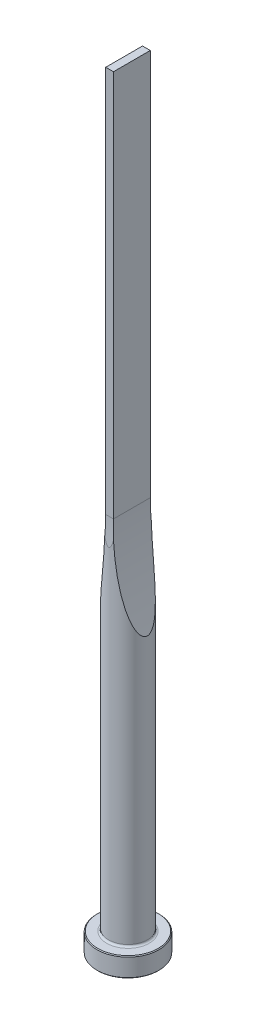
ISO-10303-21;
HEADER;
FILE_DESCRIPTION(('STEP AP214'),'2;1');
FILE_NAME('part.step','',(''),(''),'','','');
FILE_SCHEMA(('AUTOMOTIVE_DESIGN { 1 0 10303 214 1 1 1 1 }'));
ENDSEC;
DATA;
#1=APPLICATION_CONTEXT('core data for automotive mechanical design processes');
#2=APPLICATION_PROTOCOL_DEFINITION('international standard','automotive_design',2000,#1);
#3=PRODUCT_CONTEXT('',#1,'mechanical');
#4=PRODUCT('Part','Part','',(#3));
#5=PRODUCT_RELATED_PRODUCT_CATEGORY('part','',(#4));
#6=PRODUCT_DEFINITION_FORMATION('','',#4);
#7=PRODUCT_DEFINITION_CONTEXT('part definition',#1,'design');
#8=PRODUCT_DEFINITION('design','',#6,#7);
#9=PRODUCT_DEFINITION_SHAPE('','',#8);
#10=(LENGTH_UNIT() NAMED_UNIT(*) SI_UNIT(.MILLI.,.METRE.));
#11=(NAMED_UNIT(*) PLANE_ANGLE_UNIT() SI_UNIT($,.RADIAN.));
#12=(NAMED_UNIT(*) SI_UNIT($,.STERADIAN.) SOLID_ANGLE_UNIT());
#13=UNCERTAINTY_MEASURE_WITH_UNIT(LENGTH_MEASURE(1.E-05),#10,'distance_accuracy_value','');
#14=(GEOMETRIC_REPRESENTATION_CONTEXT(3) GLOBAL_UNCERTAINTY_ASSIGNED_CONTEXT((#13)) GLOBAL_UNIT_ASSIGNED_CONTEXT((#10,
#11,#12)) REPRESENTATION_CONTEXT('',''));
#15=CARTESIAN_POINT('',(0.,0.,0.));
#16=DIRECTION('',(0.,0.,1.));
#17=DIRECTION('',(1.,0.,0.));
#18=AXIS2_PLACEMENT_3D('',#15,#16,#17);
#19=CARTESIAN_POINT('',(0.,0.,0.));
#20=DIRECTION('',(0.,1.,0.));
#21=DIRECTION('',(-1.,0.,0.));
#22=AXIS2_PLACEMENT_3D('',#19,#20,#21);
#23=PLANE('',#22);
#24=CARTESIAN_POINT('',(0.,0.,0.));
#25=DIRECTION('',(0.,1.,0.));
#26=DIRECTION('',(-1.,0.,0.));
#27=AXIS2_PLACEMENT_3D('',#24,#25,#26);
#28=CIRCLE('',#27,7.8);
#29=CARTESIAN_POINT('',(-7.8,0.,0.));
#30=VERTEX_POINT('',#29);
#31=EDGE_CURVE('E133',#30,#30,#28,.T.);
#32=ORIENTED_EDGE('',*,*,#31,.F.);
#33=EDGE_LOOP('',(#32));
#34=FACE_BOUND('',#33,.T.);
#35=ADVANCED_FACE('F32',(#34),#23,.F.);
#36=CARTESIAN_POINT('',(0.,0.,0.));
#37=DIRECTION('',(0.,1.,0.));
#38=DIRECTION('',(-1.,0.,0.));
#39=AXIS2_PLACEMENT_3D('',#36,#37,#38);
#40=CONICAL_SURFACE('',#39,7.8,0.785398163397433);
#41=CARTESIAN_POINT('',(0.,0.200000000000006,0.));
#42=DIRECTION('',(0.,1.,0.));
#43=DIRECTION('',(-1.,0.,0.));
#44=AXIS2_PLACEMENT_3D('',#41,#42,#43);
#45=CIRCLE('',#44,8.);
#46=CARTESIAN_POINT('',(-8.,0.200000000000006,0.));
#47=VERTEX_POINT('',#46);
#48=EDGE_CURVE('E130',#47,#47,#45,.T.);
#49=ORIENTED_EDGE('',*,*,#48,.F.);
#50=EDGE_LOOP('',(#49));
#51=FACE_BOUND('',#50,.T.);
#52=ORIENTED_EDGE('',*,*,#31,.T.);
#53=EDGE_LOOP('',(#52));
#54=FACE_BOUND('',#53,.T.);
#55=ADVANCED_FACE('F171',(#51,#54),#40,.T.);
#56=CARTESIAN_POINT('',(0.,200.,0.));
#57=DIRECTION('',(0.,1.,0.));
#58=DIRECTION('',(-1.,0.,0.));
#59=AXIS2_PLACEMENT_3D('',#56,#57,#58);
#60=CYLINDRICAL_SURFACE('',#59,8.);
#61=CARTESIAN_POINT('',(0.,4.8,0.));
#62=DIRECTION('',(0.,1.,0.));
#63=DIRECTION('',(-1.,0.,0.));
#64=AXIS2_PLACEMENT_3D('',#61,#62,#63);
#65=CIRCLE('',#64,8.);
#66=CARTESIAN_POINT('',(-8.,4.8,0.));
#67=VERTEX_POINT('',#66);
#68=EDGE_CURVE('E127',#67,#67,#65,.T.);
#69=ORIENTED_EDGE('',*,*,#68,.F.);
#70=EDGE_LOOP('',(#69));
#71=FACE_BOUND('',#70,.T.);
#72=ORIENTED_EDGE('',*,*,#48,.T.);
#73=EDGE_LOOP('',(#72));
#74=FACE_BOUND('',#73,.T.);
#75=ADVANCED_FACE('F176',(#71,#74),#60,.T.);
#76=CARTESIAN_POINT('',(0.,4.8,0.));
#77=DIRECTION('',(0.,-1.,0.));
#78=DIRECTION('',(1.,0.,0.));
#79=AXIS2_PLACEMENT_3D('',#76,#77,#78);
#80=CONICAL_SURFACE('',#79,8.,0.785398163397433);
#81=CARTESIAN_POINT('',(0.,5.,0.));
#82=DIRECTION('',(0.,1.,0.));
#83=DIRECTION('',(-1.,0.,0.));
#84=AXIS2_PLACEMENT_3D('',#81,#82,#83);
#85=CIRCLE('',#84,7.8);
#86=CARTESIAN_POINT('',(-7.8,5.,0.));
#87=VERTEX_POINT('',#86);
#88=EDGE_CURVE('E124',#87,#87,#85,.T.);
#89=ORIENTED_EDGE('',*,*,#88,.F.);
#90=EDGE_LOOP('',(#89));
#91=FACE_BOUND('',#90,.T.);
#92=ORIENTED_EDGE('',*,*,#68,.T.);
#93=EDGE_LOOP('',(#92));
#94=FACE_BOUND('',#93,.T.);
#95=ADVANCED_FACE('F183',(#91,#94),#80,.T.);
#96=CARTESIAN_POINT('',(7.8,5.,0.));
#97=DIRECTION('',(0.,-1.,0.));
#98=DIRECTION('',(1.,0.,0.));
#99=AXIS2_PLACEMENT_3D('',#96,#97,#98);
#100=PLANE('',#99);
#101=CARTESIAN_POINT('',(0.,5.,0.));
#102=DIRECTION('',(0.,1.,0.));
#103=DIRECTION('',(-1.,0.,0.));
#104=AXIS2_PLACEMENT_3D('',#101,#102,#103);
#105=CIRCLE('',#104,5.50000000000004);
#106=CARTESIAN_POINT('',(-5.50000000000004,5.,0.));
#107=VERTEX_POINT('',#106);
#108=EDGE_CURVE('E121',#107,#107,#105,.T.);
#109=ORIENTED_EDGE('',*,*,#108,.F.);
#110=EDGE_LOOP('',(#109));
#111=FACE_BOUND('',#110,.T.);
#112=ORIENTED_EDGE('',*,*,#88,.T.);
#113=EDGE_LOOP('',(#112));
#114=FACE_BOUND('',#113,.T.);
#115=ADVANCED_FACE('F190',(#111,#114),#100,.F.);
#116=CARTESIAN_POINT('',(0.,5.5,0.));
#117=DIRECTION('',(0.,1.,0.));
#118=DIRECTION('',(-1.,0.,0.));
#119=AXIS2_PLACEMENT_3D('',#116,#117,#118);
#120=TOROIDAL_SURFACE('',#119,5.50000000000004,0.5);
#121=CARTESIAN_POINT('',(0.,5.50000000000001,0.));
#122=DIRECTION('',(0.,1.,0.));
#123=DIRECTION('',(-1.,0.,0.));
#124=AXIS2_PLACEMENT_3D('',#121,#122,#123);
#125=CIRCLE('',#124,5.00000000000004);
#126=CARTESIAN_POINT('',(-5.00000000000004,5.50000000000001,0.));
#127=VERTEX_POINT('',#126);
#128=EDGE_CURVE('E112',#127,#127,#125,.T.);
#129=ORIENTED_EDGE('',*,*,#128,.F.);
#130=EDGE_LOOP('',(#129));
#131=FACE_BOUND('',#130,.T.);
#132=ORIENTED_EDGE('',*,*,#108,.T.);
#133=EDGE_LOOP('',(#132));
#134=FACE_BOUND('',#133,.T.);
#135=ADVANCED_FACE('F168',(#131,#134),#120,.F.);
#136=CARTESIAN_POINT('',(0.,200.,0.));
#137=DIRECTION('',(0.,1.,0.));
#138=DIRECTION('',(-1.,0.,0.));
#139=AXIS2_PLACEMENT_3D('',#136,#137,#138);
#140=CYLINDRICAL_SURFACE('',#139,5.00000000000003);
#141=CARTESIAN_POINT('',(5.00000000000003,73.4670016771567,0.));
#142=CARTESIAN_POINT('',(5.00000154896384,73.4669968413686,0.0960044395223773));
#143=CARTESIAN_POINT('',(4.99720101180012,73.4760689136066,0.19199553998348));
#144=CARTESIAN_POINT('',(4.98639433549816,73.5111351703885,0.380563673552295));
#145=CARTESIAN_POINT('',(4.97838040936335,73.5371546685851,0.473135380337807));
#146=CARTESIAN_POINT('',(4.95578653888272,73.6107011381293,0.672615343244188));
#147=CARTESIAN_POINT('',(4.94013666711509,73.6617443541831,0.778078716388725));
#148=CARTESIAN_POINT('',(4.90426575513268,73.7792390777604,0.979118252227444));
#149=CARTESIAN_POINT('',(4.88403584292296,73.8457204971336,1.07467469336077));
#150=CARTESIAN_POINT('',(4.84381261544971,73.9785578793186,1.24247223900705));
#151=CARTESIAN_POINT('',(4.82425119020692,74.0433953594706,1.3160490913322));
#152=CARTESIAN_POINT('',(4.78353192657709,74.1789689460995,1.45712663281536));
#153=CARTESIAN_POINT('',(4.76237288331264,74.2497095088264,1.5246226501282));
#154=CARTESIAN_POINT('',(4.71888736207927,74.3957927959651,1.65432437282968));
#155=CARTESIAN_POINT('',(4.69655843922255,74.4711452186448,1.71651822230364));
#156=CARTESIAN_POINT('',(4.65111253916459,74.6252863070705,1.83609311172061));
#157=CARTESIAN_POINT('',(4.62799578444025,74.7040740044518,1.89347549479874));
#158=CARTESIAN_POINT('',(4.57193640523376,74.8961477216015,2.02594032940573));
#159=CARTESIAN_POINT('',(4.538730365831,75.0107315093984,2.09902518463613));
#160=CARTESIAN_POINT('',(4.47168855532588,75.2438683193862,2.23829551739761));
#161=CARTESIAN_POINT('',(4.43785249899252,75.3624231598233,2.30447777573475));
#162=CARTESIAN_POINT('',(4.36981519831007,75.6027317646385,2.43102533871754));
#163=CARTESIAN_POINT('',(4.33561346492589,75.7244902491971,2.49138136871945));
#164=CARTESIAN_POINT('',(4.26710841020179,75.9703967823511,2.60696898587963));
#165=CARTESIAN_POINT('',(4.23280507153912,76.0945452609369,2.66219964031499));
#166=CARTESIAN_POINT('',(4.12966776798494,76.4710138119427,2.82170259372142));
#167=CARTESIAN_POINT('',(4.06092380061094,76.7262382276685,2.91921456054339));
#168=CARTESIAN_POINT('',(3.95867524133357,77.1127635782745,3.05484023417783));
#169=CARTESIAN_POINT('',(3.92475237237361,77.2421597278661,3.09825753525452));
#170=CARTESIAN_POINT('',(3.85723820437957,77.5020650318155,3.18191942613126));
#171=CARTESIAN_POINT('',(3.82364690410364,77.6325741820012,3.22216402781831));
#172=CARTESIAN_POINT('',(3.73229791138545,77.9908387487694,3.32834157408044));
#173=CARTESIAN_POINT('',(3.67493060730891,78.2195440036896,3.39140657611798));
#174=CARTESIAN_POINT('',(3.56157034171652,78.6791868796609,3.5102638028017));
#175=CARTESIAN_POINT('',(3.50557755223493,78.9101247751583,3.56605512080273));
#176=CARTESIAN_POINT('',(3.39509078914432,79.3738824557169,3.67140136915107));
#177=CARTESIAN_POINT('',(3.34059749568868,79.6067030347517,3.72095350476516));
#178=CARTESIAN_POINT('',(3.23323739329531,80.0738153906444,3.81460850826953));
#179=CARTESIAN_POINT('',(3.18037067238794,80.3081072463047,3.85871108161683));
#180=CARTESIAN_POINT('',(3.02412988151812,81.0137257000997,3.98403896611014));
#181=CARTESIAN_POINT('',(2.92332782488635,81.4869034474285,4.0580878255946));
#182=CARTESIAN_POINT('',(2.72899333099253,82.4368416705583,4.19123126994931));
#183=CARTESIAN_POINT('',(2.63546167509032,82.9136025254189,4.2503242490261));
#184=CARTESIAN_POINT('',(2.50068802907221,83.6313937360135,4.3300433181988));
#185=CARTESIAN_POINT('',(2.45663062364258,83.8714118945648,4.35515634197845));
#186=CARTESIAN_POINT('',(2.37042835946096,84.3520405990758,4.40266882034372));
#187=CARTESIAN_POINT('',(2.32828335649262,84.5926510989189,4.42506847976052));
#188=CARTESIAN_POINT('',(2.20473350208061,85.3153299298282,4.48862457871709));
#189=CARTESIAN_POINT('',(2.1262190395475,85.7982177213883,4.52613511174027));
#190=CARTESIAN_POINT('',(1.97709022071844,86.7651749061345,4.59323181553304));
#191=CARTESIAN_POINT('',(1.90646690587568,87.2492423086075,4.62282702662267));
#192=CARTESIAN_POINT('',(1.77308159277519,88.2188075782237,4.67560955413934));
#193=CARTESIAN_POINT('',(1.71031965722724,88.704305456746,4.69879681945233));
#194=CARTESIAN_POINT('',(1.59289942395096,89.6748598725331,4.73988655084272));
#195=CARTESIAN_POINT('',(1.53821490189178,90.1599125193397,4.75780631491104));
#196=CARTESIAN_POINT('',(1.43673211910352,91.1309879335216,4.78942837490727));
#197=CARTESIAN_POINT('',(1.38993403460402,91.6170107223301,4.80313057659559));
#198=CARTESIAN_POINT('',(1.3042446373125,92.5898756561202,4.82710313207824));
#199=CARTESIAN_POINT('',(1.26535396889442,93.0767178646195,4.83737320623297));
#200=CARTESIAN_POINT('',(1.19549959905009,94.0510290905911,4.85510840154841));
#201=CARTESIAN_POINT('',(1.16453604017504,94.538498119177,4.86257347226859));
#202=CARTESIAN_POINT('',(1.11052476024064,95.5143299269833,4.87519312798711));
#203=CARTESIAN_POINT('',(1.08748394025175,96.0026931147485,4.88034569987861));
#204=CARTESIAN_POINT('',(1.04936282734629,96.9797496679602,4.88868116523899));
#205=CARTESIAN_POINT('',(1.03428266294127,97.4684430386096,4.89186402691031));
#206=CARTESIAN_POINT('',(1.00099348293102,98.9347439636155,4.89884013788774));
#207=CARTESIAN_POINT('',(0.994730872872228,99.9126610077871,4.90006195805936));
#208=CARTESIAN_POINT('',(1.01403027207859,101.863278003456,4.89610457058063));
#209=CARTESIAN_POINT('',(1.03943328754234,102.835979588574,4.89095734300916));
#210=CARTESIAN_POINT('',(1.10117659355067,104.293976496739,4.87727389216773));
#211=CARTESIAN_POINT('',(1.12569941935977,104.7798252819,4.87171852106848));
#212=CARTESIAN_POINT('',(1.1826168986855,105.751025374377,4.85821856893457));
#213=CARTESIAN_POINT('',(1.21501141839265,106.236376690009,4.85027402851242));
#214=CARTESIAN_POINT('',(1.28763203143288,107.206055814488,4.83150141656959));
#215=CARTESIAN_POINT('',(1.32785199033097,107.690384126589,4.82067560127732));
#216=CARTESIAN_POINT('',(1.41612183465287,108.658226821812,4.79548827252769));
#217=CARTESIAN_POINT('',(1.46417155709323,109.141741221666,4.78112683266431));
#218=CARTESIAN_POINT('',(1.5680710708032,110.107721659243,4.74806540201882));
#219=CARTESIAN_POINT('',(1.62391986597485,110.590187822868,4.72936596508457));
#220=CARTESIAN_POINT('',(1.7433874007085,111.553910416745,4.68664389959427));
#221=CARTESIAN_POINT('',(1.80700584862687,112.035166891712,4.66262147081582));
#222=CARTESIAN_POINT('',(1.91158138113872,112.779860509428,4.62033026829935));
#223=CARTESIAN_POINT('',(1.94984472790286,113.043808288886,4.60434084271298));
#224=CARTESIAN_POINT('',(2.02869323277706,113.571207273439,4.57014746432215));
#225=CARTESIAN_POINT('',(2.0692783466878,113.834658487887,4.55194355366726));
#226=CARTESIAN_POINT('',(2.19451193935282,114.624272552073,4.49362155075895));
#227=CARTESIAN_POINT('',(2.28262885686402,115.149625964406,4.44979702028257));
#228=CARTESIAN_POINT('',(2.46855242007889,116.200912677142,4.34942322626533));
#229=CARTESIAN_POINT('',(2.56641761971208,116.726828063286,4.29279410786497));
#230=CARTESIAN_POINT('',(2.77107152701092,117.774726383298,4.16363596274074));
#231=CARTESIAN_POINT('',(2.87785539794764,118.296711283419,4.0911155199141));
#232=CARTESIAN_POINT('',(3.04514240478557,119.079188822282,3.96635668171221));
#233=CARTESIAN_POINT('',(3.10247530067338,119.34158792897,3.92177383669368));
#234=CARTESIAN_POINT('',(3.2192427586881,119.86480510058,3.82650860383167));
#235=CARTESIAN_POINT('',(3.2786772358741,120.125623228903,3.77582646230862));
#236=CARTESIAN_POINT('',(3.39967776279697,120.645945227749,3.66726258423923));
#237=CARTESIAN_POINT('',(3.46124851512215,120.905444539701,3.60936412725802));
#238=CARTESIAN_POINT('',(3.58621745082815,121.421979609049,3.48522701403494));
#239=CARTESIAN_POINT('',(3.64961542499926,121.679015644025,3.41898930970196));
#240=CARTESIAN_POINT('',(3.7774951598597,122.187899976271,3.27713111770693));
#241=CARTESIAN_POINT('',(3.84196420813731,122.439773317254,3.20158985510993));
#242=CARTESIAN_POINT('',(3.97210146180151,122.939299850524,3.03863271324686));
#243=CARTESIAN_POINT('',(4.03776939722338,123.186953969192,2.95121947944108));
#244=CARTESIAN_POINT('',(4.1695193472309,123.675541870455,2.76195924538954));
#245=CARTESIAN_POINT('',(4.2355987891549,123.916497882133,2.66016919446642));
#246=CARTESIAN_POINT('',(4.33442118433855,124.271228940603,2.49337583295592));
#247=CARTESIAN_POINT('',(4.36729744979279,124.388303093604,2.43545657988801));
#248=CARTESIAN_POINT('',(4.43276290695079,124.619664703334,2.31416842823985));
#249=CARTESIAN_POINT('',(4.46535216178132,124.733952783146,2.25080076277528));
#250=CARTESIAN_POINT('',(4.52759848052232,124.950662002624,2.12262681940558));
#251=CARTESIAN_POINT('',(4.55729460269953,125.053336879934,2.05827093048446));
#252=CARTESIAN_POINT('',(4.61592874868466,125.254766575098,1.92318274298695));
#253=CARTESIAN_POINT('',(4.64486628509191,125.353518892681,1.85244646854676));
#254=CARTESIAN_POINT('',(4.70136067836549,125.5451515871,1.70396207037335));
#255=CARTESIAN_POINT('',(4.72892432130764,125.638061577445,1.6262551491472));
#256=CARTESIAN_POINT('',(4.78216227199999,125.816527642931,1.46230953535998));
#257=CARTESIAN_POINT('',(4.80783889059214,125.902092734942,1.37608159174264));
#258=CARTESIAN_POINT('',(4.85290402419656,126.051546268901,1.2065968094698));
#259=CARTESIAN_POINT('',(4.87266804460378,126.11678834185,1.12464947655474));
#260=CARTESIAN_POINT('',(4.90919794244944,126.236953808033,0.952631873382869));
#261=CARTESIAN_POINT('',(4.92596117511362,126.291868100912,0.862554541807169));
#262=CARTESIAN_POINT('',(4.95542941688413,126.388149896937,0.673062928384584));
#263=CARTESIAN_POINT('',(4.9680776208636,126.429327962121,0.573540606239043));
#264=CARTESIAN_POINT('',(4.98749102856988,126.492441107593,0.36808211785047));
#265=CARTESIAN_POINT('',(4.99427223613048,126.514428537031,0.262164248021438));
#266=CARTESIAN_POINT('',(5.00054554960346,126.534768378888,0.059957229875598));
#267=CARTESIAN_POINT('',(5.00077540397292,126.535512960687,-0.0360658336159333));
#268=CARTESIAN_POINT('',(4.99577740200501,126.519309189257,-0.226483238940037));
#269=CARTESIAN_POINT('',(4.99054546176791,126.502347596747,-0.320876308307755));
#270=CARTESIAN_POINT('',(4.97457918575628,126.450477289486,-0.513611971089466));
#271=CARTESIAN_POINT('',(4.96337346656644,126.414030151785,-0.611490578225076));
#272=CARTESIAN_POINT('',(4.93654473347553,126.326484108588,-0.799757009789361));
#273=CARTESIAN_POINT('',(4.92091437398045,126.275360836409,-0.890132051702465));
#274=CARTESIAN_POINT('',(4.87641895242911,126.129244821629,-1.11360480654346));
#275=CARTESIAN_POINT('',(4.84515754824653,126.026074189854,-1.24080589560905));
#276=CARTESIAN_POINT('',(4.77810953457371,125.803086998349,-1.47815178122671));
#277=CARTESIAN_POINT('',(4.74231048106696,125.683224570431,-1.58824774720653));
#278=CARTESIAN_POINT('',(4.66694126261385,125.428746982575,-1.79789942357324));
#279=CARTESIAN_POINT('',(4.62728518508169,125.293773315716,-1.89698164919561));
#280=CARTESIAN_POINT('',(4.54647688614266,125.016180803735,-2.08323058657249));
#281=CARTESIAN_POINT('',(4.50532306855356,124.873553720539,-2.17038408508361));
#282=CARTESIAN_POINT('',(4.42221036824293,124.58270288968,-2.33507335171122));
#283=CARTESIAN_POINT('',(4.38024993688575,124.434467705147,-2.4125879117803));
#284=CARTESIAN_POINT('',(4.29610542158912,124.134186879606,-2.55941949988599));
#285=CARTESIAN_POINT('',(4.25392145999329,123.982143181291,-2.62874060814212));
#286=CARTESIAN_POINT('',(4.1755538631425,123.696714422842,-2.75122865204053));
#287=CARTESIAN_POINT('',(4.1393612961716,123.563714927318,-2.80529603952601));
#288=CARTESIAN_POINT('',(4.06716125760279,123.295939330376,-2.90898323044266));
#289=CARTESIAN_POINT('',(4.03115380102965,123.161163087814,-2.95860267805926));
#290=CARTESIAN_POINT('',(3.92354173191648,122.754537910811,-3.10163136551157));
#291=CARTESIAN_POINT('',(3.85237701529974,122.480500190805,-3.1891658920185));
#292=CARTESIAN_POINT('',(3.71167581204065,121.927836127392,-3.35186649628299));
#293=CARTESIAN_POINT('',(3.64214267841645,121.649202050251,-3.42700874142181));
#294=CARTESIAN_POINT('',(3.50517413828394,121.088827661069,-3.56697884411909));
#295=CARTESIAN_POINT('',(3.43773897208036,120.807086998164,-3.631805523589));
#296=CARTESIAN_POINT('',(3.30484385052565,120.239687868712,-3.75315060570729));
#297=CARTESIAN_POINT('',(3.2393966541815,119.954016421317,-3.80962183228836));
#298=CARTESIAN_POINT('',(3.11101855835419,119.380743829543,-3.91515820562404));
#299=CARTESIAN_POINT('',(3.0480877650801,119.093142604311,-3.96422304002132));
#300=CARTESIAN_POINT('',(2.92493217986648,118.516727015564,-4.05594109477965));
#301=CARTESIAN_POINT('',(2.86470416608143,118.227914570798,-4.09860209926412));
#302=CARTESIAN_POINT('',(2.74695256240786,117.648991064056,-4.17843292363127));
#303=CARTESIAN_POINT('',(2.68942895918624,117.358880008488,-4.21560277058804));
#304=CARTESIAN_POINT('',(2.53355818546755,116.551892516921,-4.31217985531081));
#305=CARTESIAN_POINT('',(2.43818802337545,116.033821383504,-4.36644825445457));
#306=CARTESIAN_POINT('',(2.25638863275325,114.994985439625,-4.46310156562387));
#307=CARTESIAN_POINT('',(2.16996035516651,114.474220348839,-4.50548521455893));
#308=CARTESIAN_POINT('',(2.00615726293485,113.430382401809,-4.58077043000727));
#309=CARTESIAN_POINT('',(1.92878603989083,112.907308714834,-4.61366824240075));
#310=CARTESIAN_POINT('',(1.78322876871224,111.859490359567,-4.67185522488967));
#311=CARTESIAN_POINT('',(1.71504240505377,111.334745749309,-4.69714465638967));
#312=CARTESIAN_POINT('',(1.58778759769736,110.282872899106,-4.74167486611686));
#313=CARTESIAN_POINT('',(1.52873698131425,109.755742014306,-4.76090389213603));
#314=CARTESIAN_POINT('',(1.41995149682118,108.700363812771,-4.79447345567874));
#315=CARTESIAN_POINT('',(1.37021670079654,108.17211648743,-4.80881395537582));
#316=CARTESIAN_POINT('',(1.28009974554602,107.114839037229,-4.8335831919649));
#317=CARTESIAN_POINT('',(1.23971576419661,106.585809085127,-4.84401269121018));
#318=CARTESIAN_POINT('',(1.1683072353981,105.527068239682,-4.86172917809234));
#319=CARTESIAN_POINT('',(1.13728265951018,104.997357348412,-4.86901617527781));
#320=CARTESIAN_POINT('',(1.08466989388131,103.938730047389,-4.88100571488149));
#321=CARTESIAN_POINT('',(1.06305894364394,103.40981483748,-4.88571449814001));
#322=CARTESIAN_POINT('',(1.02917222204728,102.351670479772,-4.89296479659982));
#323=CARTESIAN_POINT('',(1.01689645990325,101.822441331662,-4.89550630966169));
#324=CARTESIAN_POINT('',(1.0016841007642,100.76380239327,-4.89864156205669));
#325=CARTESIAN_POINT('',(0.998748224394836,100.2343925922,-4.89923515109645));
#326=CARTESIAN_POINT('',(1.00221872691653,99.1756061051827,-4.89852639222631));
#327=CARTESIAN_POINT('',(1.00862508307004,98.6462294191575,-4.89722404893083));
#328=CARTESIAN_POINT('',(1.03076533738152,97.5882692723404,-4.89261183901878));
#329=CARTESIAN_POINT('',(1.0464888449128,97.059685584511,-4.88930420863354));
#330=CARTESIAN_POINT('',(1.08724906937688,96.0028967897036,-4.88040215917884));
#331=CARTESIAN_POINT('',(1.11228577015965,95.4746916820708,-4.87480774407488));
#332=CARTESIAN_POINT('',(1.17165876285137,94.4189040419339,-4.86087905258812));
#333=CARTESIAN_POINT('',(1.20599394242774,93.891321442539,-4.85254510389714));
#334=CARTESIAN_POINT('',(1.28394960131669,92.8369178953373,-4.83250425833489));
#335=CARTESIAN_POINT('',(1.32756979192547,92.3100969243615,-4.82079746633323));
#336=CARTESIAN_POINT('',(1.39938046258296,91.526772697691,-4.8002426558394));
#337=CARTESIAN_POINT('',(1.42404381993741,91.2698994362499,-4.79299742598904));
#338=CARTESIAN_POINT('',(1.47557483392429,90.7564141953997,-4.77738457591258));
#339=CARTESIAN_POINT('',(1.50244244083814,90.4998022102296,-4.76901698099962));
#340=CARTESIAN_POINT('',(1.58634730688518,89.7303876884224,-4.74204261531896));
#341=CARTESIAN_POINT('',(1.64668680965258,89.2180044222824,-4.72156420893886));
#342=CARTESIAN_POINT('',(1.77608600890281,88.1949653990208,-4.67442569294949));
#343=CARTESIAN_POINT('',(1.84513998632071,87.6843087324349,-4.64776962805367));
#344=CARTESIAN_POINT('',(1.99193759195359,86.6647054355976,-4.58677614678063));
#345=CARTESIAN_POINT('',(2.0696809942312,86.1557587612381,-4.55243893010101));
#346=CARTESIAN_POINT('',(2.20798798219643,85.2995540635,-4.48649769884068));
#347=CARTESIAN_POINT('',(2.26627559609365,84.9517320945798,-4.4574240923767));
#348=CARTESIAN_POINT('',(2.38684958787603,84.2572628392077,-4.39404053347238));
#349=CARTESIAN_POINT('',(2.44913588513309,83.9106155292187,-4.35973068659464));
#350=CARTESIAN_POINT('',(2.57765345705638,83.2186876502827,-4.28500117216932));
#351=CARTESIAN_POINT('',(2.6438849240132,82.8734071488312,-4.24458120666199));
#352=CARTESIAN_POINT('',(2.78020235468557,82.184540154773,-4.15656616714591));
#353=CARTESIAN_POINT('',(2.8502881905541,81.8409536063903,-4.10897133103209));
#354=CARTESIAN_POINT('',(3.0220420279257,81.0233200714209,-3.98528420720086));
#355=CARTESIAN_POINT('',(3.12544238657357,80.5502031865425,-3.90528915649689));
#356=CARTESIAN_POINT('',(3.28556951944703,79.8446801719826,-3.76959949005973));
#357=CARTESIAN_POINT('',(3.33978638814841,79.610183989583,-3.72175008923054));
#358=CARTESIAN_POINT('',(3.44979842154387,79.1428717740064,-3.62001659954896));
#359=CARTESIAN_POINT('',(3.50559354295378,78.9100556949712,-3.56613267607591));
#360=CARTESIAN_POINT('',(3.61627256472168,78.4561738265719,-3.45377007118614));
#361=CARTESIAN_POINT('',(3.67109727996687,78.2350232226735,-3.39557708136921));
#362=CARTESIAN_POINT('',(3.78191185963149,77.7951236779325,-3.27170533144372));
#363=CARTESIAN_POINT('',(3.83790164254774,77.5763745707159,-3.20602709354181));
#364=CARTESIAN_POINT('',(3.95085857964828,77.1417975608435,-3.0657520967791));
#365=CARTESIAN_POINT('',(4.00782644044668,76.9259719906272,-2.99114863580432));
#366=CARTESIAN_POINT('',(4.12234036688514,76.498486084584,-2.83125530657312));
#367=CARTESIAN_POINT('',(4.17988625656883,76.2868245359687,-2.7459686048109));
#368=CARTESIAN_POINT('',(4.27415528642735,75.9449180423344,-2.5954496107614));
#369=CARTESIAN_POINT('',(4.31087254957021,75.8129464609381,-2.53413927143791));
#370=CARTESIAN_POINT('',(4.38408949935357,75.5520474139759,-2.40525694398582));
#371=CARTESIAN_POINT('',(4.42058923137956,75.4231192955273,-2.33768631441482));
#372=CARTESIAN_POINT('',(4.49299970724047,75.1694490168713,-2.19529639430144));
#373=CARTESIAN_POINT('',(4.52891139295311,75.0446997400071,-2.12049036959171));
#374=CARTESIAN_POINT('',(4.59972657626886,74.8006176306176,-1.96215201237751));
#375=CARTESIAN_POINT('',(4.63463070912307,74.6812813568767,-1.87862533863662));
#376=CARTESIAN_POINT('',(4.70230429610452,74.4515780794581,-1.7021072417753));
#377=CARTESIAN_POINT('',(4.73509500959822,74.3411174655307,-1.60924745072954));
#378=CARTESIAN_POINT('',(4.7979010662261,74.1309041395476,-1.41101509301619));
#379=CARTESIAN_POINT('',(4.82791715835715,74.0311485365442,-1.30564592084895));
#380=CARTESIAN_POINT('',(4.87770376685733,73.8665741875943,-1.10298058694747));
#381=CARTESIAN_POINT('',(4.89831887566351,73.798769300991,-1.00835750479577));
#382=CARTESIAN_POINT('',(4.93513150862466,73.6781006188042,-0.80912803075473));
#383=CARTESIAN_POINT('',(4.95133579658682,73.625213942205,-0.70453726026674));
#384=CARTESIAN_POINT('',(4.97573891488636,73.5457371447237,-0.501038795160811));
#385=CARTESIAN_POINT('',(4.98472133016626,73.5165669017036,-0.403258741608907));
#386=CARTESIAN_POINT('',(4.99684527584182,73.4772205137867,-0.203641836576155));
#387=CARTESIAN_POINT('',(4.99999835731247,73.4670068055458,-0.101813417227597));
#388=CARTESIAN_POINT('',(5.00000000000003,73.4670016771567,0.));
#389=B_SPLINE_CURVE_WITH_KNOTS('',3,(#141,#142,#143,#144,#145,#146,#147,#148,#149,#150,#151,
#152,#153,#154,#155,#156,#157,#158,#159,#160,#161,#162,#163,#164,#165,#166,#167,#168,#169,#170,
#171,#172,#173,#174,#175,#176,#177,#178,#179,#180,#181,#182,#183,#184,#185,#186,#187,#188,#189,
#190,#191,#192,#193,#194,#195,#196,#197,#198,#199,#200,#201,#202,#203,#204,#205,#206,#207,#208,
#209,#210,#211,#212,#213,#214,#215,#216,#217,#218,#219,#220,#221,#222,#223,#224,#225,#226,#227,
#228,#229,#230,#231,#232,#233,#234,#235,#236,#237,#238,#239,#240,#241,#242,#243,#244,#245,#246,
#247,#248,#249,#250,#251,#252,#253,#254,#255,#256,#257,#258,#259,#260,#261,#262,#263,#264,#265,
#266,#267,#268,#269,#270,#271,#272,#273,#274,#275,#276,#277,#278,#279,#280,#281,#282,#283,#284,
#285,#286,#287,#288,#289,#290,#291,#292,#293,#294,#295,#296,#297,#298,#299,#300,#301,#302,#303,
#304,#305,#306,#307,#308,#309,#310,#311,#312,#313,#314,#315,#316,#317,#318,#319,#320,#321,#322,
#323,#324,#325,#326,#327,#328,#329,#330,#331,#332,#333,#334,#335,#336,#337,#338,#339,#340,#341,
#342,#343,#344,#345,#346,#347,#348,#349,#350,#351,#352,#353,#354,#355,#356,#357,#358,#359,#360,
#361,#362,#363,#364,#365,#366,#367,#368,#369,#370,#371,#372,#373,#374,#375,#376,#377,#378,#379,
#380,#381,#382,#383,#384,#385,#386,#387,#388),.UNSPECIFIED.,.T.,.F.,(4,2,2,2,2,2,2,2,2,2,2,2,2,
2,2,2,2,2,2,2,2,2,2,2,2,2,2,2,2,2,2,2,2,2,2,2,2,2,2,2,2,2,2,2,2,2,2,2,2,2,2,2,2,2,2,2,2,2,2,2,2,
2,2,2,2,2,2,2,2,2,2,2,2,2,2,2,2,2,2,2,2,2,2,2,2,2,2,2,2,2,2,2,2,2,2,2,2,2,2,2,2,2,2,2,2,2,2,2,2,
2,2,2,2,2,2,2,2,2,2,2,2,2,2,4),(0.,0.287558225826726,0.575546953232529,0.928165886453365,
1.28147381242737,1.5810514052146,1.88085723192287,2.18131675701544,2.48169212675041,
2.90110645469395,3.32071552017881,3.74098190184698,4.16132461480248,5.00588787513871,
5.42778120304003,5.84967295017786,6.58175259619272,7.31392340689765,8.04642102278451,
8.77895821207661,10.2468428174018,11.7148849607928,12.4508159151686,13.1866912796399,
14.6585275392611,16.1286755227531,17.598835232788,19.0641117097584,20.5294209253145,
21.994849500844,23.460304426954,24.9270326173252,26.3937844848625,29.3270218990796,
32.2455906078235,33.7050297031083,35.1644439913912,36.6227188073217,38.0809632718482,
39.5390216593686,40.9970253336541,41.7985644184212,42.600088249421,44.2033477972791,
45.8168961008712,47.429574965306,48.2463041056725,49.0630002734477,49.8816252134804,
50.7001567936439,51.5121461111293,52.3239547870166,53.1326335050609,53.5366009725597,
53.9404772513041,54.3145814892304,54.6889204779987,55.0611767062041,55.4329692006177,
55.7520934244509,56.0714975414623,56.3951401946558,56.7178972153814,57.0041451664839,
57.2906073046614,57.6040214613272,57.9179590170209,58.4153545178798,58.9141448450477,
59.4295563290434,59.9455341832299,60.4626279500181,60.979463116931,61.4235602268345,
61.8676928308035,62.7563186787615,63.6466340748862,64.5370510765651,65.4323179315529,
66.3276225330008,67.2218298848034,68.1160328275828,69.7044464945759,71.2930289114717,
72.8822391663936,74.4713948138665,76.0636134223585,77.6558443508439,79.2477647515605,
80.8396803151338,82.4277252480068,84.0157717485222,85.6039407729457,87.1921059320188,
88.7785032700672,90.3648978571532,91.9511027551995,93.5372583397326,94.3117167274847,
95.0861576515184,96.6350329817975,98.1828970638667,99.7307209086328,100.792271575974,
101.853800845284,102.915381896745,103.976927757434,105.448975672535,106.185087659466,
106.921179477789,107.626544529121,108.331860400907,109.03770927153,109.743349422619,
110.193457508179,110.643468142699,111.092668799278,111.541579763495,111.984868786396,
112.428037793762,112.781630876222,113.134678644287,113.440242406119,113.74520002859),.UNSPECIFIED.);
#390=CARTESIAN_POINT('',(1.12239470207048,95.3078719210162,-4.87239470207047));
#391=VERTEX_POINT('',#390);
#392=CARTESIAN_POINT('',(1.12239470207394,95.3078719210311,4.87239470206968));
#393=VERTEX_POINT('',#392);
#394=EDGE_CURVE('E138',#391,#393,#389,.T.);
#395=ORIENTED_EDGE('',*,*,#394,.T.);
#396=CARTESIAN_POINT('',(-1.56124949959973,100.,4.74999999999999));
#397=CARTESIAN_POINT('',(-1.56124909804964,100.280275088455,4.74999999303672));
#398=CARTESIAN_POINT('',(-1.55728190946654,100.560549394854,4.75130959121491));
#399=CARTESIAN_POINT('',(-1.54122236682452,101.120839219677,4.75654354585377));
#400=CARTESIAN_POINT('',(-1.52913016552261,101.400854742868,4.76046785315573));
#401=CARTESIAN_POINT('',(-1.49622334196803,101.960158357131,4.77091379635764));
#402=CARTESIAN_POINT('',(-1.4754141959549,102.23944679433,4.77743380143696));
#403=CARTESIAN_POINT('',(-1.42390023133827,102.796993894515,4.79304036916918));
#404=CARTESIAN_POINT('',(-1.39319740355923,103.075252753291,4.80212641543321));
#405=CARTESIAN_POINT('',(-1.32163854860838,103.616514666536,4.8223042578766));
#406=CARTESIAN_POINT('',(-1.28135596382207,103.879595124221,4.83327546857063));
#407=CARTESIAN_POINT('',(-1.21025315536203,104.272594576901,4.8513780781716));
#408=CARTESIAN_POINT('',(-1.1847279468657,104.403511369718,4.8576968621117));
#409=CARTESIAN_POINT('',(-1.12941406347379,104.66439382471,4.87085630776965));
#410=CARTESIAN_POINT('',(-1.09962649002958,104.794359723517,4.87769683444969));
#411=CARTESIAN_POINT('',(-1.04028074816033,105.030993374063,4.89066177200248));
#412=CARTESIAN_POINT('',(-1.01154252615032,105.137869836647,4.89671054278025));
#413=CARTESIAN_POINT('',(-0.949556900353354,105.350283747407,4.90910859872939));
#414=CARTESIAN_POINT('',(-0.91631063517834,105.455821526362,4.91545780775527));
#415=CARTESIAN_POINT('',(-0.844084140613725,105.664473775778,4.92837326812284));
#416=CARTESIAN_POINT('',(-0.80512588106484,105.767595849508,4.93493861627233));
#417=CARTESIAN_POINT('',(-0.719242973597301,105.970408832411,4.94819344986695));
#418=CARTESIAN_POINT('',(-0.672333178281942,106.070105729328,4.95488268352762));
#419=CARTESIAN_POINT('',(-0.590193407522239,106.21931421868,4.96512953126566));
#420=CARTESIAN_POINT('',(-0.559251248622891,106.271162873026,4.96873759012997));
#421=CARTESIAN_POINT('',(-0.492379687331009,106.371634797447,4.97581229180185));
#422=CARTESIAN_POINT('',(-0.456453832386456,106.420260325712,4.97927903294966));
#423=CARTESIAN_POINT('',(-0.392115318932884,106.495011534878,4.98466324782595));
#424=CARTESIAN_POINT('',(-0.365747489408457,106.522870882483,4.98668429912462));
#425=CARTESIAN_POINT('',(-0.309588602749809,106.57497277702,4.99048569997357));
#426=CARTESIAN_POINT('',(-0.279803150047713,106.599221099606,4.9922664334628));
#427=CARTESIAN_POINT('',(-0.226668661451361,106.63499513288,4.99490514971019));
#428=CARTESIAN_POINT('',(-0.204394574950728,106.648089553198,4.99587455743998));
#429=CARTESIAN_POINT('',(-0.158090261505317,106.670718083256,4.99755352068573));
#430=CARTESIAN_POINT('',(-0.134063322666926,106.680258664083,4.9982635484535));
#431=CARTESIAN_POINT('',(-0.088651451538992,106.693589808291,4.99925686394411));
#432=CARTESIAN_POINT('',(-0.0674708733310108,106.698062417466,4.99959071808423));
#433=CARTESIAN_POINT('',(-0.0246551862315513,106.703342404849,4.99998491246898));
#434=CARTESIAN_POINT('',(-0.00302040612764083,106.704152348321,5.00004544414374));
#435=CARTESIAN_POINT('',(0.0400515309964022,106.702017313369,4.99988599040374));
#436=CARTESIAN_POINT('',(0.0614887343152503,106.699073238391,4.99966607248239));
#437=CARTESIAN_POINT('',(0.103598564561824,106.689756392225,4.99897114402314));
#438=CARTESIAN_POINT('',(0.124270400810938,106.683380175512,4.99849587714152));
#439=CARTESIAN_POINT('',(0.172649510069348,106.664591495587,4.99709843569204));
#440=CARTESIAN_POINT('',(0.199804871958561,106.650779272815,4.99607315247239));
#441=CARTESIAN_POINT('',(0.251622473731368,106.619113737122,4.99373231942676));
#442=CARTESIAN_POINT('',(0.276277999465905,106.601249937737,4.99241601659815));
#443=CARTESIAN_POINT('',(0.342266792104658,106.547223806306,4.98845446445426));
#444=CARTESIAN_POINT('',(0.380989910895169,106.507933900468,4.98559441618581));
#445=CARTESIAN_POINT('',(0.452759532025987,106.424556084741,4.9795880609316));
#446=CARTESIAN_POINT('',(0.48578793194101,106.380453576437,4.9764408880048));
#447=CARTESIAN_POINT('',(0.565503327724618,106.263121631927,4.96816187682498));
#448=CARTESIAN_POINT('',(0.609051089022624,106.187790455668,4.96293429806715));
#449=CARTESIAN_POINT('',(0.689220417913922,106.033476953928,4.95243210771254));
#450=CARTESIAN_POINT('',(0.725825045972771,105.954486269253,4.94715741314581));
#451=CARTESIAN_POINT('',(0.794127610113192,105.793921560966,4.93665480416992));
#452=CARTESIAN_POINT('',(0.825798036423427,105.712335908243,4.9314272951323));
#453=CARTESIAN_POINT('',(0.885154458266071,105.54785443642,4.92111763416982));
#454=CARTESIAN_POINT('',(0.912845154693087,105.464960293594,4.91603531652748));
#455=CARTESIAN_POINT('',(0.991561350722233,105.213800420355,4.90099061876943));
#456=CARTESIAN_POINT('',(1.03784195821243,105.044035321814,4.89129471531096));
#457=CARTESIAN_POINT('',(1.12160376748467,104.702272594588,4.87276151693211));
#458=CARTESIAN_POINT('',(1.15907938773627,104.530273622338,4.86392476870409));
#459=CARTESIAN_POINT('',(1.22728467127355,104.184529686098,4.84716510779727));
#460=CARTESIAN_POINT('',(1.25799984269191,104.010781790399,4.83924417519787));
#461=CARTESIAN_POINT('',(1.31385289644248,103.662342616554,4.82437696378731));
#462=CARTESIAN_POINT('',(1.33899000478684,103.487651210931,4.81743082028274));
#463=CARTESIAN_POINT('',(1.40734156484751,102.962576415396,4.79809189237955));
#464=CARTESIAN_POINT('',(1.44349272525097,102.611211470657,4.78719953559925));
#465=CARTESIAN_POINT('',(1.50080391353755,101.907652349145,4.76953198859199));
#466=CARTESIAN_POINT('',(1.52198194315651,101.555459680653,4.76275185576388));
#467=CARTESIAN_POINT('',(1.55100340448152,100.854340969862,4.75337976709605));
#468=CARTESIAN_POINT('',(1.55899037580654,100.505421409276,4.75074274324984));
#469=CARTESIAN_POINT('',(1.56268162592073,99.8073741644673,4.7495290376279));
#470=CARTESIAN_POINT('',(1.55838094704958,99.4582464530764,4.75095399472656));
#471=CARTESIAN_POINT('',(1.53718974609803,98.7610124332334,4.75785466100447));
#472=CARTESIAN_POINT('',(1.52032131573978,98.4129054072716,4.76332326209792));
#473=CARTESIAN_POINT('',(1.47267594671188,97.71783213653,4.77826818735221));
#474=CARTESIAN_POINT('',(1.44190352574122,97.3708655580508,4.7877432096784));
#475=CARTESIAN_POINT('',(1.36365394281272,96.6788269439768,4.81063411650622));
#476=CARTESIAN_POINT('',(1.31617630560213,96.3337549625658,4.82405011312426));
#477=CARTESIAN_POINT('',(1.22782468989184,95.8192451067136,4.84699228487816));
#478=CARTESIAN_POINT('',(1.19552315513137,95.6482783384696,4.85510823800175));
#479=CARTESIAN_POINT('',(1.12372438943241,95.307953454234,4.87222905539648));
#480=CARTESIAN_POINT('',(1.08422969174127,95.1385947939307,4.88123360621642));
#481=CARTESIAN_POINT('',(0.995702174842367,94.8020881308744,4.90006914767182));
#482=CARTESIAN_POINT('',(0.946657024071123,94.6349432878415,4.9099011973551));
#483=CARTESIAN_POINT('',(0.862537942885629,94.3876900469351,4.92512126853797));
#484=CARTESIAN_POINT('',(0.832712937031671,94.3057885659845,4.93027740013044));
#485=CARTESIAN_POINT('',(0.768517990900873,94.1438098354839,4.94069314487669));
#486=CARTESIAN_POINT('',(0.734150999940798,94.0637314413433,4.94595268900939));
#487=CARTESIAN_POINT('',(0.659074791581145,93.9059985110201,4.95651780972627));
#488=CARTESIAN_POINT('',(0.618328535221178,93.8283615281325,4.96182347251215));
#489=CARTESIAN_POINT('',(0.5280373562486,93.6784981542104,4.97225145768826));
#490=CARTESIAN_POINT('',(0.478541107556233,93.6062448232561,4.97737461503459));
#491=CARTESIAN_POINT('',(0.401827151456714,93.5160227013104,4.98386702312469));
#492=CARTESIAN_POINT('',(0.380686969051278,93.4929646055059,4.98553608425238));
#493=CARTESIAN_POINT('',(0.336184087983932,93.4489774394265,4.98873561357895));
#494=CARTESIAN_POINT('',(0.312817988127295,93.4280517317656,4.99026586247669));
#495=CARTESIAN_POINT('',(0.263265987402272,93.3890935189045,4.99312671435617));
#496=CARTESIAN_POINT('',(0.237049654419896,93.3710986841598,4.99445470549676));
#497=CARTESIAN_POINT('',(0.181897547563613,93.339882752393,4.99676560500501));
#498=CARTESIAN_POINT('',(0.152971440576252,93.3266454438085,4.99774968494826));
#499=CARTESIAN_POINT('',(0.102298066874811,93.3099073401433,4.99899606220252));
#500=CARTESIAN_POINT('',(0.0811370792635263,93.3046559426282,4.9993878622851));
#501=CARTESIAN_POINT('',(0.0382302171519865,93.2977984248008,4.99989968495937));
#502=CARTESIAN_POINT('',(0.0164849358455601,93.2961887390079,5.00001997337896));
#503=CARTESIAN_POINT('',(-0.0269727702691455,93.2967972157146,4.99997452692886));
#504=CARTESIAN_POINT('',(-0.0486851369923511,93.2990193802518,4.99980849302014));
#505=CARTESIAN_POINT('',(-0.0914351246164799,93.3070432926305,4.99920977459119));
#506=CARTESIAN_POINT('',(-0.112472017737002,93.3128487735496,4.99877681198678));
#507=CARTESIAN_POINT('',(-0.160507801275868,93.3300165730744,4.99749910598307));
#508=CARTESIAN_POINT('',(-0.187061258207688,93.3426047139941,4.9965638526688));
#509=CARTESIAN_POINT('',(-0.237848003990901,93.3717782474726,4.99440467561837));
#510=CARTESIAN_POINT('',(-0.262075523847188,93.3883732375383,4.9931800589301));
#511=CARTESIAN_POINT('',(-0.325987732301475,93.4380605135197,4.98953016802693));
#512=CARTESIAN_POINT('',(-0.363355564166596,93.4740766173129,4.98690191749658));
#513=CARTESIAN_POINT('',(-0.43279234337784,93.550821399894,4.98135512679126));
#514=CARTESIAN_POINT('',(-0.464844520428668,93.591564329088,4.97843571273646));
#515=CARTESIAN_POINT('',(-0.540982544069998,93.6983286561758,4.97086484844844));
#516=CARTESIAN_POINT('',(-0.582371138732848,93.7662443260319,4.96611994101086));
#517=CARTESIAN_POINT('',(-0.658822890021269,93.9055932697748,4.95655294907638));
#518=CARTESIAN_POINT('',(-0.693870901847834,93.9770344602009,4.95173070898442));
#519=CARTESIAN_POINT('',(-0.759457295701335,94.1224166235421,4.94209752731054));
#520=CARTESIAN_POINT('',(-0.789969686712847,94.1963692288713,4.93728679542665));
#521=CARTESIAN_POINT('',(-0.847303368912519,94.3455758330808,4.92776956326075));
#522=CARTESIAN_POINT('',(-0.874128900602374,94.4208282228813,4.92306294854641));
#523=CARTESIAN_POINT('',(-0.949689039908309,94.6463197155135,4.90924878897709));
#524=CARTESIAN_POINT('',(-0.994217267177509,94.797976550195,4.90033504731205));
#525=CARTESIAN_POINT('',(-1.07533721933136,95.1034617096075,4.8831686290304));
#526=CARTESIAN_POINT('',(-1.11192387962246,95.2572913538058,4.87491637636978));
#527=CARTESIAN_POINT('',(-1.17902124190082,95.5666372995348,4.85912545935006));
#528=CARTESIAN_POINT('',(-1.20951893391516,95.7221564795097,4.85158834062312));
#529=CARTESIAN_POINT('',(-1.26550324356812,96.034136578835,4.83728492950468));
#530=CARTESIAN_POINT('',(-1.29098915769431,96.1905976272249,4.83051874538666));
#531=CARTESIAN_POINT('',(-1.36110123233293,96.6607309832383,4.81142337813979));
#532=CARTESIAN_POINT('',(-1.39943115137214,96.9753952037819,4.80028500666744));
#533=CARTESIAN_POINT('',(-1.46294686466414,97.6057174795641,4.7813010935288));
#534=CARTESIAN_POINT('',(-1.48814772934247,97.9213739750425,4.77345177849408));
#535=CARTESIAN_POINT('',(-1.52589501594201,98.5308764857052,4.76151277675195));
#536=CARTESIAN_POINT('',(-1.53921639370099,98.8246708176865,4.75719469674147));
#537=CARTESIAN_POINT('',(-1.55689016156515,99.4123105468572,4.7514394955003));
#538=CARTESIAN_POINT('',(-1.56124992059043,99.7061557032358,4.75000000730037));
#539=CARTESIAN_POINT('',(-1.56124949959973,100.,4.74999999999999));
#540=B_SPLINE_CURVE_WITH_KNOTS('',3,(#396,#397,#398,#399,#400,#401,#402,#403,#404,#405,#406,
#407,#408,#409,#410,#411,#412,#413,#414,#415,#416,#417,#418,#419,#420,#421,#422,#423,#424,#425,
#426,#427,#428,#429,#430,#431,#432,#433,#434,#435,#436,#437,#438,#439,#440,#441,#442,#443,#444,
#445,#446,#447,#448,#449,#450,#451,#452,#453,#454,#455,#456,#457,#458,#459,#460,#461,#462,#463,
#464,#465,#466,#467,#468,#469,#470,#471,#472,#473,#474,#475,#476,#477,#478,#479,#480,#481,#482,
#483,#484,#485,#486,#487,#488,#489,#490,#491,#492,#493,#494,#495,#496,#497,#498,#499,#500,#501,
#502,#503,#504,#505,#506,#507,#508,#509,#510,#511,#512,#513,#514,#515,#516,#517,#518,#519,#520,
#521,#522,#523,#524,#525,#526,#527,#528,#529,#530,#531,#532,#533,#534,#535,#536,#537,#538,#539),
.UNSPECIFIED.,.T.,.F.,(4,2,2,2,2,2,2,2,2,2,2,2,2,2,2,2,2,2,2,2,2,2,2,2,2,2,2,2,2,2,2,2,2,2,2,2,
2,2,2,2,2,2,2,2,2,2,2,2,2,2,2,2,2,2,2,2,2,2,2,2,2,2,2,2,2,2,2,2,2,2,2,4),(0.,0.840791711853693,
1.68156761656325,2.52181611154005,3.36189563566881,4.16066974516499,4.56121101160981,
4.9616489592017,5.2940899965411,5.62644722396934,5.95755811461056,6.28805720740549,
6.46935117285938,6.65051674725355,6.76554794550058,6.88039313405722,6.95773039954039,
7.03492614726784,7.09958926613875,7.16420708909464,7.22880936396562,7.29347661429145,
7.38440430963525,7.4755700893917,7.64035473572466,7.80565391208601,8.06649360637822,
8.32796172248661,8.59083911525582,8.85340339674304,9.38168636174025,9.91030331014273,
10.4400426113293,10.9698553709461,12.0295389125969,13.087946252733,14.1347586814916,
15.1819935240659,16.2273918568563,17.2724507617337,18.3175394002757,18.8399593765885,
19.3621957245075,19.8851109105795,20.1469677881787,20.4086554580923,20.6719230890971,
20.933769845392,21.0276393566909,21.1216546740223,21.2167964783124,21.3116109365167,
21.3767537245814,21.4418327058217,21.5069796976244,21.5721946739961,21.6598966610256,
21.7478108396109,21.9028287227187,22.0583267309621,22.296743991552,22.5357234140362,
22.7760234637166,23.0160447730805,23.4906125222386,23.9654820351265,24.4413555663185,
24.9172958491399,25.8684364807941,26.8184829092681,27.7007063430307,28.5822040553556),.UNSPECIFIED.);
#541=CARTESIAN_POINT('',(-1.12239470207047,95.3078719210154,4.87239470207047));
#542=VERTEX_POINT('',#541);
#543=EDGE_CURVE('E104',#393,#542,#540,.T.);
#544=ORIENTED_EDGE('',*,*,#543,.T.);
#545=CARTESIAN_POINT('',(-5.00000000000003,73.4670016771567,0.));
#546=CARTESIAN_POINT('',(-5.00000154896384,73.4669968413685,-0.0960044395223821));
#547=CARTESIAN_POINT('',(-4.99720101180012,73.4760689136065,-0.191995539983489));
#548=CARTESIAN_POINT('',(-4.98639433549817,73.5111351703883,-0.380563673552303));
#549=CARTESIAN_POINT('',(-4.97838040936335,73.537154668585,-0.47313538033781));
#550=CARTESIAN_POINT('',(-4.95578653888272,73.6107011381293,-0.672615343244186));
#551=CARTESIAN_POINT('',(-4.94013666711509,73.661744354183,-0.778078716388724));
#552=CARTESIAN_POINT('',(-4.90426575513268,73.7792390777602,-0.979118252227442));
#553=CARTESIAN_POINT('',(-4.88403584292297,73.8457204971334,-1.07467469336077));
#554=CARTESIAN_POINT('',(-4.84381261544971,73.9785578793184,-1.24247223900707));
#555=CARTESIAN_POINT('',(-4.82425119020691,74.0433953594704,-1.31604909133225));
#556=CARTESIAN_POINT('',(-4.78353192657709,74.1789689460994,-1.45712663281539));
#557=CARTESIAN_POINT('',(-4.76237288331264,74.2497095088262,-1.52462265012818));
#558=CARTESIAN_POINT('',(-4.71888736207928,74.3957927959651,-1.65432437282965));
#559=CARTESIAN_POINT('',(-4.69655843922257,74.4711452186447,-1.71651822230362));
#560=CARTESIAN_POINT('',(-4.6511125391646,74.6252863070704,-1.8360931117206));
#561=CARTESIAN_POINT('',(-4.62799578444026,74.7040740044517,-1.89347549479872));
#562=CARTESIAN_POINT('',(-4.57193640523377,74.8961477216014,-2.02594032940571));
#563=CARTESIAN_POINT('',(-4.53873036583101,75.0107315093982,-2.09902518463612));
#564=CARTESIAN_POINT('',(-4.47168855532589,75.243868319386,-2.2382955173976));
#565=CARTESIAN_POINT('',(-4.43785249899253,75.3624231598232,-2.30447777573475));
#566=CARTESIAN_POINT('',(-4.36981519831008,75.6027317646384,-2.43102533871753));
#567=CARTESIAN_POINT('',(-4.33561346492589,75.7244902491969,-2.49138136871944));
#568=CARTESIAN_POINT('',(-4.2671084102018,75.9703967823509,-2.60696898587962));
#569=CARTESIAN_POINT('',(-4.23280507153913,76.0945452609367,-2.66219964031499));
#570=CARTESIAN_POINT('',(-4.12966776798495,76.4710138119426,-2.82170259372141));
#571=CARTESIAN_POINT('',(-4.06092380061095,76.7262382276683,-2.91921456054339));
#572=CARTESIAN_POINT('',(-3.95867524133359,77.1127635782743,-3.05484023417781));
#573=CARTESIAN_POINT('',(-3.92475237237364,77.2421597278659,-3.09825753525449));
#574=CARTESIAN_POINT('',(-3.8572382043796,77.5020650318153,-3.18191942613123));
#575=CARTESIAN_POINT('',(-3.82364690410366,77.632574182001,-3.22216402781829));
#576=CARTESIAN_POINT('',(-3.73229791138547,77.9908387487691,-3.32834157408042));
#577=CARTESIAN_POINT('',(-3.67493060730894,78.2195440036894,-3.39140657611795));
#578=CARTESIAN_POINT('',(-3.56157034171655,78.6791868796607,-3.51026380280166));
#579=CARTESIAN_POINT('',(-3.50557755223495,78.9101247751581,-3.56605512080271));
#580=CARTESIAN_POINT('',(-3.39509078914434,79.3738824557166,-3.67140136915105));
#581=CARTESIAN_POINT('',(-3.34059749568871,79.6067030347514,-3.72095350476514));
#582=CARTESIAN_POINT('',(-3.23323739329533,80.0738153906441,-3.8146085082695));
#583=CARTESIAN_POINT('',(-3.18037067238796,80.3081072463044,-3.85871108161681));
#584=CARTESIAN_POINT('',(-3.02412988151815,81.0137257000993,-3.98403896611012));
#585=CARTESIAN_POINT('',(-2.9233278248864,81.4869034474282,-4.05808782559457));
#586=CARTESIAN_POINT('',(-2.72899333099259,82.4368416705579,-4.19123126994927));
#587=CARTESIAN_POINT('',(-2.63546167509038,82.9136025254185,-4.25032424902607));
#588=CARTESIAN_POINT('',(-2.50068802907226,83.6313937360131,-4.33004331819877));
#589=CARTESIAN_POINT('',(-2.45663062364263,83.8714118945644,-4.35515634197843));
#590=CARTESIAN_POINT('',(-2.37042835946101,84.3520405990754,-4.4026688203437));
#591=CARTESIAN_POINT('',(-2.32828335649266,84.5926510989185,-4.4250684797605));
#592=CARTESIAN_POINT('',(-2.20473350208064,85.3153299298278,-4.48862457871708));
#593=CARTESIAN_POINT('',(-2.12621903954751,85.7982177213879,-4.52613511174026));
#594=CARTESIAN_POINT('',(-1.97709022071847,86.765174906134,-4.59323181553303));
#595=CARTESIAN_POINT('',(-1.90646690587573,87.249242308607,-4.62282702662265));
#596=CARTESIAN_POINT('',(-1.77308159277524,88.2188075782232,-4.67560955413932));
#597=CARTESIAN_POINT('',(-1.71031965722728,88.7043054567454,-4.69879681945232));
#598=CARTESIAN_POINT('',(-1.59289942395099,89.6748598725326,-4.73988655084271));
#599=CARTESIAN_POINT('',(-1.53821490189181,90.1599125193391,-4.75780631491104));
#600=CARTESIAN_POINT('',(-1.43673211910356,91.130987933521,-4.78942837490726));
#601=CARTESIAN_POINT('',(-1.38993403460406,91.6170107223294,-4.80313057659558));
#602=CARTESIAN_POINT('',(-1.30424463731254,92.5898756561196,-4.82710313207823));
#603=CARTESIAN_POINT('',(-1.26535396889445,93.0767178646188,-4.83737320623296));
#604=CARTESIAN_POINT('',(-1.1954995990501,94.0510290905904,-4.85510840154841));
#605=CARTESIAN_POINT('',(-1.16453604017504,94.5384981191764,-4.86257347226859));
#606=CARTESIAN_POINT('',(-1.11052476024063,95.5143299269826,-4.87519312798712));
#607=CARTESIAN_POINT('',(-1.08748394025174,96.0026931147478,-4.88034569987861));
#608=CARTESIAN_POINT('',(-1.04936282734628,96.9797496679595,-4.88868116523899));
#609=CARTESIAN_POINT('',(-1.03428266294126,97.4684430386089,-4.89186402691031));
#610=CARTESIAN_POINT('',(-1.000993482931,98.9347439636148,-4.89884013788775));
#611=CARTESIAN_POINT('',(-0.994730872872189,99.9126610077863,-4.90006195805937));
#612=CARTESIAN_POINT('',(-1.01403027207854,101.863278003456,-4.89610457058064));
#613=CARTESIAN_POINT('',(-1.03943328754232,102.835979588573,-4.89095734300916));
#614=CARTESIAN_POINT('',(-1.1011765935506,104.293976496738,-4.87727389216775));
#615=CARTESIAN_POINT('',(-1.12569941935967,104.779825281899,-4.8717185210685));
#616=CARTESIAN_POINT('',(-1.18261689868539,105.751025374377,-4.8582185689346));
#617=CARTESIAN_POINT('',(-1.21501141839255,106.236376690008,-4.85027402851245));
#618=CARTESIAN_POINT('',(-1.28763203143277,107.206055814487,-4.83150141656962));
#619=CARTESIAN_POINT('',(-1.32785199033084,107.690384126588,-4.82067560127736));
#620=CARTESIAN_POINT('',(-1.41612183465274,108.658226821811,-4.79548827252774));
#621=CARTESIAN_POINT('',(-1.4641715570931,109.141741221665,-4.78112683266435));
#622=CARTESIAN_POINT('',(-1.56807107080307,110.107721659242,-4.74806540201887));
#623=CARTESIAN_POINT('',(-1.6239198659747,110.590187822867,-4.72936596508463));
#624=CARTESIAN_POINT('',(-1.74338740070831,111.553910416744,-4.68664389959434));
#625=CARTESIAN_POINT('',(-1.80700584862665,112.035166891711,-4.66262147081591));
#626=CARTESIAN_POINT('',(-1.91158138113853,112.779860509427,-4.62033026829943));
#627=CARTESIAN_POINT('',(-1.94984472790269,113.043808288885,-4.60434084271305));
#628=CARTESIAN_POINT('',(-2.02869323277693,113.571207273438,-4.57014746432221));
#629=CARTESIAN_POINT('',(-2.06927834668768,113.834658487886,-4.55194355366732));
#630=CARTESIAN_POINT('',(-2.19451193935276,114.624272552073,-4.49362155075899));
#631=CARTESIAN_POINT('',(-2.28262885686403,115.149625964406,-4.44979702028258));
#632=CARTESIAN_POINT('',(-2.46855242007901,116.200912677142,-4.34942322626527));
#633=CARTESIAN_POINT('',(-2.56641761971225,116.726828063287,-4.29279410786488));
#634=CARTESIAN_POINT('',(-2.77107152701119,117.7747263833,-4.16363596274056));
#635=CARTESIAN_POINT('',(-2.87785539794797,118.296711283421,-4.09111551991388));
#636=CARTESIAN_POINT('',(-3.04514240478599,119.079188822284,-3.96635668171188));
#637=CARTESIAN_POINT('',(-3.10247530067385,119.341587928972,-3.92177383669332));
#638=CARTESIAN_POINT('',(-3.21924275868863,119.864805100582,-3.82650860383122));
#639=CARTESIAN_POINT('',(-3.27867723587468,120.125623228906,-3.77582646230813));
#640=CARTESIAN_POINT('',(-3.39967776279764,120.645945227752,-3.66726258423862));
#641=CARTESIAN_POINT('',(-3.46124851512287,120.905444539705,-3.60936412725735));
#642=CARTESIAN_POINT('',(-3.58621745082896,121.421979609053,-3.48522701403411));
#643=CARTESIAN_POINT('',(-3.64961542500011,121.679015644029,-3.41898930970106));
#644=CARTESIAN_POINT('',(-3.77749515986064,122.187899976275,-3.27713111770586));
#645=CARTESIAN_POINT('',(-3.84196420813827,122.439773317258,-3.20158985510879));
#646=CARTESIAN_POINT('',(-3.97210146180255,122.939299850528,-3.03863271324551));
#647=CARTESIAN_POINT('',(-4.03776939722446,123.186953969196,-2.95121947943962));
#648=CARTESIAN_POINT('',(-4.16951934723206,123.67554187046,-2.7619592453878));
#649=CARTESIAN_POINT('',(-4.23559878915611,123.916497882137,-2.66016919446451));
#650=CARTESIAN_POINT('',(-4.33442118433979,124.271228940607,-2.49337583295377));
#651=CARTESIAN_POINT('',(-4.36729744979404,124.388303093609,-2.43545657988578));
#652=CARTESIAN_POINT('',(-4.43276290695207,124.619664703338,-2.3141684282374));
#653=CARTESIAN_POINT('',(-4.46535216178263,124.73395278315,-2.25080076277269));
#654=CARTESIAN_POINT('',(-4.52759848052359,124.950662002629,-2.12262681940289));
#655=CARTESIAN_POINT('',(-4.55729460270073,125.053336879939,-2.05827093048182));
#656=CARTESIAN_POINT('',(-4.61592874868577,125.254766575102,-1.92318274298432));
#657=CARTESIAN_POINT('',(-4.64486628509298,125.353518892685,-1.85244646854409));
#658=CARTESIAN_POINT('',(-4.70136067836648,125.545151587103,-1.70396207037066));
#659=CARTESIAN_POINT('',(-4.72892432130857,125.638061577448,-1.62625514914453));
#660=CARTESIAN_POINT('',(-4.7821622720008,125.816527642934,-1.46230953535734));
#661=CARTESIAN_POINT('',(-4.80783889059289,125.902092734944,-1.37608159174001));
#662=CARTESIAN_POINT('',(-4.85290402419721,126.051546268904,-1.20659680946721));
#663=CARTESIAN_POINT('',(-4.87266804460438,126.116788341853,-1.12464947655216));
#664=CARTESIAN_POINT('',(-4.90919794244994,126.236953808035,-0.95263187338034));
#665=CARTESIAN_POINT('',(-4.92596117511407,126.291868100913,-0.862554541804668));
#666=CARTESIAN_POINT('',(-4.95542941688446,126.388149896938,-0.673062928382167));
#667=CARTESIAN_POINT('',(-4.96807762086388,126.429327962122,-0.573540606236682));
#668=CARTESIAN_POINT('',(-4.98749102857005,126.492441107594,-0.368082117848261));
#669=CARTESIAN_POINT('',(-4.9942722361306,126.514428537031,-0.262164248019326));
#670=CARTESIAN_POINT('',(-5.00054554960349,126.534768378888,-0.0599572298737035));
#671=CARTESIAN_POINT('',(-5.00077540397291,126.535512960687,0.0360658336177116));
#672=CARTESIAN_POINT('',(-4.99577740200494,126.519309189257,0.22648323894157));
#673=CARTESIAN_POINT('',(-4.99054546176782,126.502347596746,0.320876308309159));
#674=CARTESIAN_POINT('',(-4.97457918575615,126.450477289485,0.513611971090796));
#675=CARTESIAN_POINT('',(-4.96337346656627,126.414030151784,0.611490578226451));
#676=CARTESIAN_POINT('',(-4.9365447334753,126.326484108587,0.799757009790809));
#677=CARTESIAN_POINT('',(-4.92091437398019,126.275360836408,0.890132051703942));
#678=CARTESIAN_POINT('',(-4.87641895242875,126.129244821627,1.1136048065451));
#679=CARTESIAN_POINT('',(-4.8451575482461,126.026074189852,1.24080589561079));
#680=CARTESIAN_POINT('',(-4.77810953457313,125.803086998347,1.47815178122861));
#681=CARTESIAN_POINT('',(-4.74231048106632,125.683224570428,1.58824774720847));
#682=CARTESIAN_POINT('',(-4.66694126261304,125.428746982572,1.79789942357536));
#683=CARTESIAN_POINT('',(-4.62728518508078,125.293773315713,1.89698164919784));
#684=CARTESIAN_POINT('',(-4.54647688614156,125.016180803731,2.08323058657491));
#685=CARTESIAN_POINT('',(-4.50532306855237,124.873553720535,2.1703840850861));
#686=CARTESIAN_POINT('',(-4.42221036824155,124.582702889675,2.33507335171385));
#687=CARTESIAN_POINT('',(-4.38024993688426,124.434467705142,2.412587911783));
#688=CARTESIAN_POINT('',(-4.29610542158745,124.1341868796,2.5594194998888));
#689=CARTESIAN_POINT('',(-4.25392145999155,123.982143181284,2.62874060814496));
#690=CARTESIAN_POINT('',(-4.17555386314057,123.696714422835,2.75122865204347));
#691=CARTESIAN_POINT('',(-4.13936129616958,123.56371492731,2.80529603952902));
#692=CARTESIAN_POINT('',(-4.06716125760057,123.295939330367,2.90898323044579));
#693=CARTESIAN_POINT('',(-4.03115380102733,123.161163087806,2.95860267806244));
#694=CARTESIAN_POINT('',(-3.92354173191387,122.754537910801,3.10163136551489));
#695=CARTESIAN_POINT('',(-3.85237701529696,122.480500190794,3.18916589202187));
#696=CARTESIAN_POINT('',(-3.71167581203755,121.927836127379,3.35186649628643));
#697=CARTESIAN_POINT('',(-3.6421426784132,121.649202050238,3.42700874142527));
#698=CARTESIAN_POINT('',(-3.50517413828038,121.088827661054,3.5669788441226));
#699=CARTESIAN_POINT('',(-3.43773897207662,120.807086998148,3.63180552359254));
#700=CARTESIAN_POINT('',(-3.30484385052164,120.239687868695,3.75315060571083));
#701=CARTESIAN_POINT('',(-3.23939665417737,119.954016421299,3.80962183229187));
#702=CARTESIAN_POINT('',(-3.11101855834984,119.380743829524,3.91515820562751));
#703=CARTESIAN_POINT('',(-3.04808776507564,119.093142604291,3.96422304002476));
#704=CARTESIAN_POINT('',(-2.92493217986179,118.516727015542,4.05594109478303));
#705=CARTESIAN_POINT('',(-2.86470416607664,118.227914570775,4.09860209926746));
#706=CARTESIAN_POINT('',(-2.7469525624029,117.648991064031,4.17843292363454));
#707=CARTESIAN_POINT('',(-2.68942895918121,117.358880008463,4.21560277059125));
#708=CARTESIAN_POINT('',(-2.53355818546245,116.551892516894,4.31217985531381));
#709=CARTESIAN_POINT('',(-2.43818802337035,116.033821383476,4.36644825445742));
#710=CARTESIAN_POINT('',(-2.25638863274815,114.994985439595,4.46310156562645));
#711=CARTESIAN_POINT('',(-2.16996035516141,114.474220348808,4.50548521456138));
#712=CARTESIAN_POINT('',(-2.00615726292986,113.430382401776,4.58077043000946));
#713=CARTESIAN_POINT('',(-1.92878603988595,112.9073087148,4.61366824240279));
#714=CARTESIAN_POINT('',(-1.78322876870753,111.859490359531,4.67185522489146));
#715=CARTESIAN_POINT('',(-1.71504240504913,111.334745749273,4.69714465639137));
#716=CARTESIAN_POINT('',(-1.58778759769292,110.282872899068,4.74167486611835));
#717=CARTESIAN_POINT('',(-1.52873698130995,109.755742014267,4.76090389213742));
#718=CARTESIAN_POINT('',(-1.41995149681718,108.700363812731,4.79447345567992));
#719=CARTESIAN_POINT('',(-1.3702167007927,108.172116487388,4.80881395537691));
#720=CARTESIAN_POINT('',(-1.28009974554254,107.114839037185,4.83358319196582));
#721=CARTESIAN_POINT('',(-1.23971576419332,106.585809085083,4.84401269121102));
#722=CARTESIAN_POINT('',(-1.16830723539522,105.527068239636,4.86172917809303));
#723=CARTESIAN_POINT('',(-1.13728265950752,104.997357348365,4.86901617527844));
#724=CARTESIAN_POINT('',(-1.08466989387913,103.93873004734,4.88100571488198));
#725=CARTESIAN_POINT('',(-1.06305894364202,103.40981483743,4.88571449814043));
#726=CARTESIAN_POINT('',(-1.02917222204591,102.35167047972,4.89296479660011));
#727=CARTESIAN_POINT('',(-1.01689645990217,101.822441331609,4.89550630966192));
#728=CARTESIAN_POINT('',(-1.00168410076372,100.763802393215,4.89864156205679));
#729=CARTESIAN_POINT('',(-0.998748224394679,100.234392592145,4.89923515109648));
#730=CARTESIAN_POINT('',(-1.00221872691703,99.1756061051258,4.89852639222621));
#731=CARTESIAN_POINT('',(-1.00862508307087,98.6462294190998,4.89722404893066));
#732=CARTESIAN_POINT('',(-1.03076533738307,97.588269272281,4.89261183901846));
#733=CARTESIAN_POINT('',(-1.04648884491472,97.0596855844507,4.88930420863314));
#734=CARTESIAN_POINT('',(-1.08724906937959,96.0028967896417,4.88040215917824));
#735=CARTESIAN_POINT('',(-1.11228577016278,95.474691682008,4.87480774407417));
#736=CARTESIAN_POINT('',(-1.17165876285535,94.4189040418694,4.86087905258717));
#737=CARTESIAN_POINT('',(-1.20599394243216,93.8913214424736,4.85254510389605));
#738=CARTESIAN_POINT('',(-1.283949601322,92.8369178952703,4.83250425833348));
#739=CARTESIAN_POINT('',(-1.32756979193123,92.3100969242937,4.82079746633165));
#740=CARTESIAN_POINT('',(-1.39938046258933,91.5267726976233,4.80024265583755));
#741=CARTESIAN_POINT('',(-1.42404381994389,91.269899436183,4.79299742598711));
#742=CARTESIAN_POINT('',(-1.47557483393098,90.7564141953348,4.77738457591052));
#743=CARTESIAN_POINT('',(-1.50244244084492,90.4998022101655,4.76901698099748));
#744=CARTESIAN_POINT('',(-1.5863473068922,89.7303876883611,4.74204261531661));
#745=CARTESIAN_POINT('',(-1.64668680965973,89.2180044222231,4.72156420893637));
#746=CARTESIAN_POINT('',(-1.77608600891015,88.1949653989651,4.6744256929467));
#747=CARTESIAN_POINT('',(-1.84513998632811,87.6843087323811,4.64776962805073));
#748=CARTESIAN_POINT('',(-1.99193759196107,86.6647054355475,4.58677614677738));
#749=CARTESIAN_POINT('',(-2.06968099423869,86.1557587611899,4.55243893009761));
#750=CARTESIAN_POINT('',(-2.20798798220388,85.2995540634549,4.48649769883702));
#751=CARTESIAN_POINT('',(-2.26627559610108,84.9517320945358,4.45742409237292));
#752=CARTESIAN_POINT('',(-2.38684958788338,84.2572628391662,4.39404053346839));
#753=CARTESIAN_POINT('',(-2.44913588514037,83.9106155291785,4.35973068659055));
#754=CARTESIAN_POINT('',(-2.57765345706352,83.218687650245,4.28500117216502));
#755=CARTESIAN_POINT('',(-2.64388492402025,82.8734071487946,4.2445812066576));
#756=CARTESIAN_POINT('',(-2.78020235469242,82.1845401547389,4.15656616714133));
#757=CARTESIAN_POINT('',(-2.85028819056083,81.8409536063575,4.10897133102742));
#758=CARTESIAN_POINT('',(-3.02204202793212,81.023320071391,3.98528420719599));
#759=CARTESIAN_POINT('',(-3.1254423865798,80.5502031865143,3.9052891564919));
#760=CARTESIAN_POINT('',(-3.28556951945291,79.8446801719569,3.76959949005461));
#761=CARTESIAN_POINT('',(-3.33978638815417,79.6101839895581,3.72175008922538));
#762=CARTESIAN_POINT('',(-3.44979842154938,79.1428717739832,3.62001659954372));
#763=CARTESIAN_POINT('',(-3.50559354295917,78.9100556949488,3.56613267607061));
#764=CARTESIAN_POINT('',(-3.61627256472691,78.4561738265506,3.45377007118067));
#765=CARTESIAN_POINT('',(-3.67109727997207,78.2350232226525,3.39557708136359));
#766=CARTESIAN_POINT('',(-3.78191185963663,77.7951236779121,3.27170533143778));
#767=CARTESIAN_POINT('',(-3.83790164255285,77.5763745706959,3.2060270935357));
#768=CARTESIAN_POINT('',(-3.95085857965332,77.1417975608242,3.06575209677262));
#769=CARTESIAN_POINT('',(-4.00782644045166,76.9259719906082,2.99114863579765));
#770=CARTESIAN_POINT('',(-4.12234036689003,76.4984860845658,2.83125530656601));
#771=CARTESIAN_POINT('',(-4.17988625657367,76.2868245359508,2.74596860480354));
#772=CARTESIAN_POINT('',(-4.27415528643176,75.9449180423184,2.59544961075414));
#773=CARTESIAN_POINT('',(-4.31087254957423,75.8129464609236,2.53413927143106));
#774=CARTESIAN_POINT('',(-4.38408949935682,75.5520474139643,2.40525694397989));
#775=CARTESIAN_POINT('',(-4.42058923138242,75.4231192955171,2.3376863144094));
#776=CARTESIAN_POINT('',(-4.49299970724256,75.1694490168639,2.19529639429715));
#777=CARTESIAN_POINT('',(-4.52891139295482,75.044699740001,2.12049036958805));
#778=CARTESIAN_POINT('',(-4.59972657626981,74.8006176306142,1.96215201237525));
#779=CARTESIAN_POINT('',(-4.63463070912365,74.6812813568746,1.87862533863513));
#780=CARTESIAN_POINT('',(-4.70230429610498,74.4515780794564,1.70210724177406));
#781=CARTESIAN_POINT('',(-4.7350950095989,74.3411174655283,1.6092474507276));
#782=CARTESIAN_POINT('',(-4.79790106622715,74.130904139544,1.41101509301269));
#783=CARTESIAN_POINT('',(-4.82791715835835,74.0311485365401,1.30564592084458));
#784=CARTESIAN_POINT('',(-4.87770376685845,73.8665741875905,1.10298058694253));
#785=CARTESIAN_POINT('',(-4.89831887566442,73.7987693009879,1.00835750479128));
#786=CARTESIAN_POINT('',(-4.93513150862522,73.6781006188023,0.80912803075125));
#787=CARTESIAN_POINT('',(-4.95133579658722,73.6252139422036,0.704537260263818));
#788=CARTESIAN_POINT('',(-4.97573891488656,73.545737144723,0.501038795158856));
#789=CARTESIAN_POINT('',(-4.98472133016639,73.5165669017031,0.403258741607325));
#790=CARTESIAN_POINT('',(-4.99684527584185,73.4772205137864,0.203641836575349));
#791=CARTESIAN_POINT('',(-4.99999835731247,73.4670068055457,0.101813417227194));
#792=CARTESIAN_POINT('',(-5.00000000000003,73.4670016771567,0.));
#793=B_SPLINE_CURVE_WITH_KNOTS('',3,(#545,#546,#547,#548,#549,#550,#551,#552,#553,#554,#555,
#556,#557,#558,#559,#560,#561,#562,#563,#564,#565,#566,#567,#568,#569,#570,#571,#572,#573,#574,
#575,#576,#577,#578,#579,#580,#581,#582,#583,#584,#585,#586,#587,#588,#589,#590,#591,#592,#593,
#594,#595,#596,#597,#598,#599,#600,#601,#602,#603,#604,#605,#606,#607,#608,#609,#610,#611,#612,
#613,#614,#615,#616,#617,#618,#619,#620,#621,#622,#623,#624,#625,#626,#627,#628,#629,#630,#631,
#632,#633,#634,#635,#636,#637,#638,#639,#640,#641,#642,#643,#644,#645,#646,#647,#648,#649,#650,
#651,#652,#653,#654,#655,#656,#657,#658,#659,#660,#661,#662,#663,#664,#665,#666,#667,#668,#669,
#670,#671,#672,#673,#674,#675,#676,#677,#678,#679,#680,#681,#682,#683,#684,#685,#686,#687,#688,
#689,#690,#691,#692,#693,#694,#695,#696,#697,#698,#699,#700,#701,#702,#703,#704,#705,#706,#707,
#708,#709,#710,#711,#712,#713,#714,#715,#716,#717,#718,#719,#720,#721,#722,#723,#724,#725,#726,
#727,#728,#729,#730,#731,#732,#733,#734,#735,#736,#737,#738,#739,#740,#741,#742,#743,#744,#745,
#746,#747,#748,#749,#750,#751,#752,#753,#754,#755,#756,#757,#758,#759,#760,#761,#762,#763,#764,
#765,#766,#767,#768,#769,#770,#771,#772,#773,#774,#775,#776,#777,#778,#779,#780,#781,#782,#783,
#784,#785,#786,#787,#788,#789,#790,#791,#792),.UNSPECIFIED.,.T.,.F.,(4,2,2,2,2,2,2,2,2,2,2,2,2,
2,2,2,2,2,2,2,2,2,2,2,2,2,2,2,2,2,2,2,2,2,2,2,2,2,2,2,2,2,2,2,2,2,2,2,2,2,2,2,2,2,2,2,2,2,2,2,2,
2,2,2,2,2,2,2,2,2,2,2,2,2,2,2,2,2,2,2,2,2,2,2,2,2,2,2,2,2,2,2,2,2,2,2,2,2,2,2,2,2,2,2,2,2,2,2,2,
2,2,2,2,2,2,2,2,2,2,2,2,2,2,4),(0.,0.28755822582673,0.575546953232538,0.928165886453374,
1.28147381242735,1.5810514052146,1.88085723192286,2.18131675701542,2.48169212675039,
2.90110645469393,3.32071552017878,3.74098190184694,4.16132461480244,5.00588787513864,
5.42778120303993,5.84967295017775,6.58175259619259,7.31392340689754,8.04642102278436,
8.77895821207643,10.2468428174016,11.7148849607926,12.4508159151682,13.1866912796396,
14.6585275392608,16.1286755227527,17.5988352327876,19.0641117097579,20.529420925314,
21.9948495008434,23.4603044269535,24.9270326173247,26.3937844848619,29.327021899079,
32.2455906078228,33.7050297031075,35.1644439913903,36.6227188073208,38.0809632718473,
39.5390216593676,40.997025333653,41.7985644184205,42.6000882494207,44.2033477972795,
45.8168961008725,47.4295749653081,48.2463041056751,49.0630002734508,49.8816252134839,
50.7001567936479,51.5121461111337,52.3239547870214,53.1326335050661,53.5366009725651,
53.9404772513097,54.3145814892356,54.6889204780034,55.0611767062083,55.4329692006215,
55.7520934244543,56.0714975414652,56.3951401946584,56.7178972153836,57.0041451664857,
57.2906073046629,57.604021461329,57.9179590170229,58.4153545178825,58.9141448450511,
59.4295563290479,59.9455341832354,60.4626279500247,60.9794631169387,61.4235602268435,
61.8676928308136,62.7563186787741,63.6466340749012,64.5370510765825,65.4323179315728,
66.3276225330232,67.2218298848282,68.1160328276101,69.7044464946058,71.2930289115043,
72.8822391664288,74.4713948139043,76.063613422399,77.655844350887,79.2477647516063,
80.8396803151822,82.4277252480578,84.0157717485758,85.603940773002,87.1921059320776,
88.7785032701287,90.3648978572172,91.9511027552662,93.5372583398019,94.3117167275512,
95.0861576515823,96.6350329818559,98.1828970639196,99.7307209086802,100.792271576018,
101.853800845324,102.915381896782,103.976927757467,105.448975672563,106.185087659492,
106.921179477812,107.626544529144,108.331860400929,109.037709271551,109.743349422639,
110.193457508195,110.64346814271,111.092668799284,111.541579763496,111.984868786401,
112.42803779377,112.781630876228,113.13467864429,113.440242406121,113.74520002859),.UNSPECIFIED.);
#794=CARTESIAN_POINT('',(-1.12239470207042,95.3078719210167,-4.87239470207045));
#795=VERTEX_POINT('',#794);
#796=EDGE_CURVE('E103',#542,#795,#793,.T.);
#797=ORIENTED_EDGE('',*,*,#796,.T.);
#798=CARTESIAN_POINT('',(0.,93.2964561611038,-5.00000000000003));
#799=CARTESIAN_POINT('',(0.0232323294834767,93.2964572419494,-4.99999991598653));
#800=CARTESIAN_POINT('',(0.0464684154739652,93.298650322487,-4.99983603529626));
#801=CARTESIAN_POINT('',(0.0921784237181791,93.3071370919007,-4.99920277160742));
#802=CARTESIAN_POINT('',(0.114651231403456,93.3134365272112,-4.99873296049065));
#803=CARTESIAN_POINT('',(0.164453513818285,93.3317101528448,-4.99737321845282));
#804=CARTESIAN_POINT('',(0.191371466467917,93.3447820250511,-4.9964022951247));
#805=CARTESIAN_POINT('',(0.242796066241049,93.3749802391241,-4.9941681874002));
#806=CARTESIAN_POINT('',(0.267297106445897,93.3921157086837,-4.99290434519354));
#807=CARTESIAN_POINT('',(0.3320700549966,93.4434725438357,-4.98913428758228));
#808=CARTESIAN_POINT('',(0.369929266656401,93.4806778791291,-4.98642172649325));
#809=CARTESIAN_POINT('',(0.440212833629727,93.5598314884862,-4.98070773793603));
#810=CARTESIAN_POINT('',(0.472619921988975,93.6017941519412,-4.9777054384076));
#811=CARTESIAN_POINT('',(0.550070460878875,93.7123895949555,-4.9698770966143));
#812=CARTESIAN_POINT('',(0.592256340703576,93.7829934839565,-4.96495647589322));
#813=CARTESIAN_POINT('',(0.670083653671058,93.9277686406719,-4.95504844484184));
#814=CARTESIAN_POINT('',(0.705709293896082,94.0019479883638,-4.950060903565));
#815=CARTESIAN_POINT('',(0.772305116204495,94.152835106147,-4.94010964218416));
#816=CARTESIAN_POINT('',(0.80324890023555,94.2295544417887,-4.93514619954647));
#817=CARTESIAN_POINT('',(0.861338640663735,94.384297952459,-4.925337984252));
#818=CARTESIAN_POINT('',(0.888489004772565,94.4623204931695,-4.9204930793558));
#819=CARTESIAN_POINT('',(0.965232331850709,94.6970919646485,-4.90622652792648));
#820=CARTESIAN_POINT('',(1.01042466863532,94.8552890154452,-4.89702379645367));
#821=CARTESIAN_POINT('',(1.09256170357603,95.1738777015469,-4.87934814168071));
#822=CARTESIAN_POINT('',(1.12950115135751,95.3342706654,-4.8708756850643));
#823=CARTESIAN_POINT('',(1.19706371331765,95.6567661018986,-4.85471406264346));
#824=CARTESIAN_POINT('',(1.22767325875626,95.8188714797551,-4.84702659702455));
#825=CARTESIAN_POINT('',(1.28367887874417,96.1440252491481,-4.83249355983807));
#826=CARTESIAN_POINT('',(1.30907422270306,96.3070737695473,-4.82564810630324));
#827=CARTESIAN_POINT('',(1.37869253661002,96.7972695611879,-4.80640976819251));
#828=CARTESIAN_POINT('',(1.41633613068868,97.1254079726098,-4.79531787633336));
#829=CARTESIAN_POINT('',(1.47781312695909,97.7826102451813,-4.77671953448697));
#830=CARTESIAN_POINT('',(1.5016631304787,98.1116725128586,-4.76920877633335));
#831=CARTESIAN_POINT('',(1.53923764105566,98.803477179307,-4.75722432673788));
#832=CARTESIAN_POINT('',(1.55170973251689,99.1662940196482,-4.75312986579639));
#833=CARTESIAN_POINT('',(1.56328959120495,99.892312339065,-4.74933187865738));
#834=CARTESIAN_POINT('',(1.56239143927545,100.255513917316,-4.74963029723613));
#835=CARTESIAN_POINT('',(1.54715699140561,100.980954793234,-4.75461657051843));
#836=CARTESIAN_POINT('',(1.53284521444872,101.343194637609,-4.75929641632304));
#837=CARTESIAN_POINT('',(1.48961521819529,102.066609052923,-4.77300304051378));
#838=CARTESIAN_POINT('',(1.4607018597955,102.427783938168,-4.78202837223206));
#839=CARTESIAN_POINT('',(1.38555972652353,103.148188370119,-4.80435754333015));
#840=CARTESIAN_POINT('',(1.3393366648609,103.507418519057,-4.81765997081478));
#841=CARTESIAN_POINT('',(1.25243146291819,104.043251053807,-4.84068947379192));
#842=CARTESIAN_POINT('',(1.22053902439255,104.221340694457,-4.84887756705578));
#843=CARTESIAN_POINT('',(1.14941573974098,104.575956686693,-4.86622996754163));
#844=CARTESIAN_POINT('',(1.11018729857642,104.752483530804,-4.87539395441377));
#845=CARTESIAN_POINT('',(1.0220665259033,105.103378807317,-4.89463643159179));
#846=CARTESIAN_POINT('',(0.973163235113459,105.277744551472,-4.90471595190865));
#847=CARTESIAN_POINT('',(0.889190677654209,105.535943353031,-4.92037900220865));
#848=CARTESIAN_POINT('',(0.859407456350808,105.621505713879,-4.92569427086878));
#849=CARTESIAN_POINT('',(0.795286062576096,105.790882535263,-4.9364550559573));
#850=CARTESIAN_POINT('',(0.760950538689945,105.874697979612,-4.94190049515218));
#851=CARTESIAN_POINT('',(0.685976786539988,106.040000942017,-4.95286586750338));
#852=CARTESIAN_POINT('',(0.64530650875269,106.121473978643,-4.95838604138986));
#853=CARTESIAN_POINT('',(0.555229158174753,106.279323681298,-4.96928808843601));
#854=CARTESIAN_POINT('',(0.505864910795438,106.355722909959,-4.97467049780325));
#855=CARTESIAN_POINT('',(0.428907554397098,106.452679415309,-4.9816111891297));
#856=CARTESIAN_POINT('',(0.407336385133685,106.477948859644,-4.98343175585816));
#857=CARTESIAN_POINT('',(0.361846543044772,106.526411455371,-4.98694224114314));
#858=CARTESIAN_POINT('',(0.337923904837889,106.549600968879,-4.98863193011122));
#859=CARTESIAN_POINT('',(0.287053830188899,106.593136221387,-4.99181910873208));
#860=CARTESIAN_POINT('',(0.260073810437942,106.613444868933,-4.9933140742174));
#861=CARTESIAN_POINT('',(0.203045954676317,106.649205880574,-4.99595617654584));
#862=CARTESIAN_POINT('',(0.173009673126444,106.664675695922,-4.99710456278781));
#863=CARTESIAN_POINT('',(0.121059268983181,106.684463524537,-4.99857655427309));
#864=CARTESIAN_POINT('',(0.0999204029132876,106.690787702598,-4.99904802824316));
#865=CARTESIAN_POINT('',(0.0568816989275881,106.69982978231,-4.99972255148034));
#866=CARTESIAN_POINT('',(0.0349827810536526,106.702551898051,-4.99992591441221));
#867=CARTESIAN_POINT('',(-0.00901857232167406,106.704084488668,-5.00004037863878));
#868=CARTESIAN_POINT('',(-0.0311214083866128,106.702883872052,-4.99995065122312));
#869=CARTESIAN_POINT('',(-0.0747889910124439,106.696692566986,-4.99948848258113));
#870=CARTESIAN_POINT('',(-0.0963532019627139,106.691698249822,-4.9991157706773));
#871=CARTESIAN_POINT('',(-0.144030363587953,106.676666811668,-4.99799617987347));
#872=CARTESIAN_POINT('',(-0.16982565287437,106.665641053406,-4.99717609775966));
#873=CARTESIAN_POINT('',(-0.219321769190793,106.63964518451,-4.99524924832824));
#874=CARTESIAN_POINT('',(-0.243017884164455,106.624666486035,-4.99414185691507));
#875=CARTESIAN_POINT('',(-0.304309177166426,106.58038362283,-4.99088167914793));
#876=CARTESIAN_POINT('',(-0.339944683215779,106.548418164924,-4.98854178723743));
#877=CARTESIAN_POINT('',(-0.406395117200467,106.47988545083,-4.98356816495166));
#878=CARTESIAN_POINT('',(-0.437194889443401,106.443304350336,-4.98093355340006));
#879=CARTESIAN_POINT('',(-0.508794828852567,106.349363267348,-4.97423090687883));
#880=CARTESIAN_POINT('',(-0.547418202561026,106.290370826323,-4.97007519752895));
#881=CARTESIAN_POINT('',(-0.619074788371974,106.169043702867,-4.96165647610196));
#882=CARTESIAN_POINT('',(-0.652095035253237,106.106701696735,-4.95739324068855));
#883=CARTESIAN_POINT('',(-0.714101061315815,105.979648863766,-4.9488425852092));
#884=CARTESIAN_POINT('',(-0.743064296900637,105.914927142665,-4.94455515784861));
#885=CARTESIAN_POINT('',(-0.797660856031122,105.784196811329,-4.93604027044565));
#886=CARTESIAN_POINT('',(-0.823297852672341,105.718189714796,-4.93181274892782));
#887=CARTESIAN_POINT('',(-0.894303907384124,105.524128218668,-4.91960249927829));
#888=CARTESIAN_POINT('',(-0.936161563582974,105.394784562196,-4.91173813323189));
#889=CARTESIAN_POINT('',(-1.01301147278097,105.134026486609,-4.89645866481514));
#890=CARTESIAN_POINT('',(-1.04799936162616,105.002610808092,-4.88904385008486));
#891=CARTESIAN_POINT('',(-1.14522422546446,104.60585665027,-4.8675421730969));
#892=CARTESIAN_POINT('',(-1.19954636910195,104.338542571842,-4.8542316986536));
#893=CARTESIAN_POINT('',(-1.29398676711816,103.8009524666,-4.8298940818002));
#894=CARTESIAN_POINT('',(-1.33407858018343,103.530671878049,-4.81887120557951));
#895=CARTESIAN_POINT('',(-1.40306594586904,102.988963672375,-4.79923878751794));
#896=CARTESIAN_POINT('',(-1.43197571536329,102.717537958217,-4.79062618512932));
#897=CARTESIAN_POINT('',(-1.47939682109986,102.186378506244,-4.77618688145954));
#898=CARTESIAN_POINT('',(-1.49832705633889,101.926684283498,-4.77024980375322));
#899=CARTESIAN_POINT('',(-1.52863865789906,101.406807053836,-4.76061996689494));
#900=CARTESIAN_POINT('',(-1.54001935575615,101.146624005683,-4.75692740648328));
#901=CARTESIAN_POINT('',(-1.56370224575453,100.365168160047,-4.7492328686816));
#902=CARTESIAN_POINT('',(-1.56550333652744,99.84348651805,-4.74862760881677));
#903=CARTESIAN_POINT('',(-1.5474669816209,99.0626220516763,-4.75450666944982));
#904=CARTESIAN_POINT('',(-1.53803680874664,98.8031123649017,-4.75758500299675));
#905=CARTESIAN_POINT('',(-1.5118411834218,98.2845047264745,-4.76597757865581));
#906=CARTESIAN_POINT('',(-1.49507638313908,98.0254067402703,-4.77129162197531));
#907=CARTESIAN_POINT('',(-1.45346556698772,97.5081571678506,-4.78413094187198));
#908=CARTESIAN_POINT('',(-1.42862717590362,97.2500049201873,-4.79165413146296));
#909=CARTESIAN_POINT('',(-1.36954555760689,96.7348734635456,-4.80887863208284));
#910=CARTESIAN_POINT('',(-1.33530436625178,96.4778940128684,-4.8185794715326));
#911=CARTESIAN_POINT('',(-1.26843730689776,96.0511563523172,-4.83650906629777));
#912=CARTESIAN_POINT('',(-1.23907380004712,95.8808627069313,-4.84415153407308));
#913=CARTESIAN_POINT('',(-1.1739727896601,95.5414880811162,-4.86034258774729));
#914=CARTESIAN_POINT('',(-1.13823443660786,95.3724072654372,-4.86889129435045));
#915=CARTESIAN_POINT('',(-1.07076712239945,95.0877381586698,-4.88408140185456));
#916=CARTESIAN_POINT('',(-1.04116563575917,94.9716354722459,-4.89050449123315));
#917=CARTESIAN_POINT('',(-0.977066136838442,94.7408699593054,-4.90371525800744));
#918=CARTESIAN_POINT('',(-0.942571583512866,94.6262061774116,-4.91050267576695));
#919=CARTESIAN_POINT('',(-0.87845853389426,94.4330921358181,-4.92229885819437));
#920=CARTESIAN_POINT('',(-0.850480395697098,94.354094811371,-4.92723054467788));
#921=CARTESIAN_POINT('',(-0.790548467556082,94.1976384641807,-4.93720173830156));
#922=CARTESIAN_POINT('',(-0.758596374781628,94.1201788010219,-4.94224119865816));
#923=CARTESIAN_POINT('',(-0.687336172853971,93.9629256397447,-4.95267083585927));
#924=CARTESIAN_POINT('',(-0.647696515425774,93.883281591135,-4.95806352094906));
#925=CARTESIAN_POINT('',(-0.560133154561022,93.7287394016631,-4.96872584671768));
#926=CARTESIAN_POINT('',(-0.512241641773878,93.653824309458,-4.97399587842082));
#927=CARTESIAN_POINT('',(-0.435993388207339,93.5558017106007,-4.98100132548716));
#928=CARTESIAN_POINT('',(-0.413090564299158,93.5285127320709,-4.9829651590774));
#929=CARTESIAN_POINT('',(-0.364608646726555,93.4762508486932,-4.98674817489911));
#930=CARTESIAN_POINT('',(-0.339023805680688,93.4512831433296,-4.98856703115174));
#931=CARTESIAN_POINT('',(-0.284299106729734,93.404566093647,-4.99198750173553));
#932=CARTESIAN_POINT('',(-0.255110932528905,93.3828717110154,-4.99358537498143));
#933=CARTESIAN_POINT('',(-0.193183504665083,93.3453268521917,-4.99636118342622));
#934=CARTESIAN_POINT('',(-0.160463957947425,93.3294459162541,-4.99754130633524));
#935=CARTESIAN_POINT('',(-0.105967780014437,93.3109500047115,-4.99891833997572));
#936=CARTESIAN_POINT('',(-0.0851398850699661,93.3055668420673,-4.99931990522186));
#937=CARTESIAN_POINT('',(-0.0428753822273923,93.2983208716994,-4.99986066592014));
#938=CARTESIAN_POINT('',(-0.0214392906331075,93.2964551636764,-5.00000007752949));
#939=CARTESIAN_POINT('',(0.,93.2964561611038,-5.00000000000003));
#940=B_SPLINE_CURVE_WITH_KNOTS('',3,(#798,#799,#800,#801,#802,#803,#804,#805,#806,#807,#808,
#809,#810,#811,#812,#813,#814,#815,#816,#817,#818,#819,#820,#821,#822,#823,#824,#825,#826,#827,
#828,#829,#830,#831,#832,#833,#834,#835,#836,#837,#838,#839,#840,#841,#842,#843,#844,#845,#846,
#847,#848,#849,#850,#851,#852,#853,#854,#855,#856,#857,#858,#859,#860,#861,#862,#863,#864,#865,
#866,#867,#868,#869,#870,#871,#872,#873,#874,#875,#876,#877,#878,#879,#880,#881,#882,#883,#884,
#885,#886,#887,#888,#889,#890,#891,#892,#893,#894,#895,#896,#897,#898,#899,#900,#901,#902,#903,
#904,#905,#906,#907,#908,#909,#910,#911,#912,#913,#914,#915,#916,#917,#918,#919,#920,#921,#922,
#923,#924,#925,#926,#927,#928,#929,#930,#931,#932,#933,#934,#935,#936,#937,#938,#939),
.UNSPECIFIED.,.T.,.F.,(4,2,2,2,2,2,2,2,2,2,2,2,2,2,2,2,2,2,2,2,2,2,2,2,2,2,2,2,2,2,2,2,2,2,2,2,
2,2,2,2,2,2,2,2,2,2,2,2,2,2,2,2,2,2,2,2,2,2,2,2,2,2,2,2,2,2,2,2,2,2,4),(0.,0.0696071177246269,
0.139311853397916,0.228619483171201,0.318129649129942,0.476683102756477,0.635729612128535,
0.882282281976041,1.129420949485,1.37790493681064,1.62609775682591,2.12007062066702,
2.61435685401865,3.10969189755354,3.60509629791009,4.59608573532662,5.58587996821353,
6.67474437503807,7.76409084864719,8.85144996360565,9.93844733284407,11.0250862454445,
11.5682882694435,12.1113125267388,12.6549554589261,12.9271301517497,13.1991471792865,
13.4725880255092,13.7447178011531,13.8444334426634,13.9443202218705,14.045394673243,
14.1461002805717,14.2120438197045,14.2779101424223,14.3439628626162,14.4100788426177,
14.4937991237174,14.5777028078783,14.7206765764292,14.8640898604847,15.0754587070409,
15.2873101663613,15.500295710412,15.7130440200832,16.12125487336,16.52972421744,
17.3483401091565,18.168469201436,18.9875521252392,19.7687724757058,20.5500619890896,
22.114138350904,22.8931580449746,23.6721084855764,24.4503254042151,25.2283739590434,
25.7472114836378,26.2661182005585,26.6260086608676,26.9856459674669,27.2374224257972,
27.4890917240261,27.7562389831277,28.0223667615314,28.1292830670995,28.236433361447,
28.3452197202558,28.4534276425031,28.5177156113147,28.5819505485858),.UNSPECIFIED.);
#941=EDGE_CURVE('E115',#795,#391,#940,.T.);
#942=ORIENTED_EDGE('',*,*,#941,.T.);
#943=EDGE_LOOP('',(#395,#544,#797,#942));
#944=FACE_BOUND('',#943,.T.);
#945=ORIENTED_EDGE('',*,*,#128,.T.);
#946=EDGE_LOOP('',(#945));
#947=FACE_BOUND('',#946,.T.);
#948=ADVANCED_FACE('F147',(#944,#947),#140,.T.);
#949=CARTESIAN_POINT('',(0.,200.,0.));
#950=DIRECTION('',(0.,-1.,0.));
#951=DIRECTION('',(1.,0.,0.));
#952=AXIS2_PLACEMENT_3D('',#949,#950,#951);
#953=PLANE('',#952);
#954=DIRECTION('',(0.,0.,1.));
#955=VECTOR('',#954,1.);
#956=CARTESIAN_POINT('',(-1.00000000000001,200.,0.));
#957=LINE('',#956,#955);
#958=CARTESIAN_POINT('',(-0.999999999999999,200.,-4.75));
#959=VERTEX_POINT('',#958);
#960=CARTESIAN_POINT('',(-1.00000000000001,200.,4.74999999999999));
#961=VERTEX_POINT('',#960);
#962=EDGE_CURVE('E145',#959,#961,#957,.T.);
#963=ORIENTED_EDGE('',*,*,#962,.T.);
#964=DIRECTION('',(1.,0.,0.));
#965=VECTOR('',#964,1.);
#966=CARTESIAN_POINT('',(-5.,200.,4.75));
#967=LINE('',#966,#965);
#968=CARTESIAN_POINT('',(1.,200.,4.75));
#969=VERTEX_POINT('',#968);
#970=EDGE_CURVE('E46',#961,#969,#967,.T.);
#971=ORIENTED_EDGE('',*,*,#970,.T.);
#972=DIRECTION('',(0.,0.,-1.));
#973=VECTOR('',#972,1.);
#974=CARTESIAN_POINT('',(0.99999999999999,200.,0.));
#975=LINE('',#974,#973);
#976=CARTESIAN_POINT('',(1.,200.,-4.75));
#977=VERTEX_POINT('',#976);
#978=EDGE_CURVE('E136',#969,#977,#975,.T.);
#979=ORIENTED_EDGE('',*,*,#978,.T.);
#980=DIRECTION('',(1.,0.,0.));
#981=VECTOR('',#980,1.);
#982=CARTESIAN_POINT('',(-5.,200.,-4.75));
#983=LINE('',#982,#981);
#984=EDGE_CURVE('E291',#959,#977,#983,.T.);
#985=ORIENTED_EDGE('',*,*,#984,.F.);
#986=EDGE_LOOP('',(#963,#971,#979,#985));
#987=FACE_BOUND('',#986,.T.);
#988=ADVANCED_FACE('F157',(#987),#953,.F.);
#989=CARTESIAN_POINT('',(91.,100.,-5.));
#990=DIRECTION('',(0.,0.,1.));
#991=DIRECTION('',(1.,0.,0.));
#992=AXIS2_PLACEMENT_3D('',#989,#990,#991);
#993=CYLINDRICAL_SURFACE('',#992,90.);
#994=DIRECTION('',(0.,0.,1.));
#995=VECTOR('',#994,1.);
#996=CARTESIAN_POINT('',(1.00000000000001,100.,-5.));
#997=LINE('',#996,#995);
#998=CARTESIAN_POINT('',(1.,100.,-4.75000000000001));
#999=VERTEX_POINT('',#998);
#1000=CARTESIAN_POINT('',(1.00000000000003,100.,4.74999999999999));
#1001=VERTEX_POINT('',#1000);
#1002=EDGE_CURVE('E108',#999,#1001,#997,.T.);
#1003=ORIENTED_EDGE('',*,*,#1002,.T.);
#1004=CARTESIAN_POINT('',(91.,100.,94.75));
#1005=DIRECTION('',(-0.707106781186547,0.,0.707106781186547));
#1006=DIRECTION('',(0.707106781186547,0.,0.707106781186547));
#1007=AXIS2_PLACEMENT_3D('',#1004,#1005,#1006);
#1008=ELLIPSE('',#1007,127.279220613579,90.);
#1009=EDGE_CURVE('E96',#1001,#393,#1008,.T.);
#1010=ORIENTED_EDGE('',*,*,#1009,.T.);
#1011=ORIENTED_EDGE('',*,*,#394,.F.);
#1012=CARTESIAN_POINT('',(91.,100.,-94.75));
#1013=DIRECTION('',(0.707106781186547,0.,0.707106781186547));
#1014=DIRECTION('',(-0.707106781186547,0.,0.707106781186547));
#1015=AXIS2_PLACEMENT_3D('',#1012,#1013,#1014);
#1016=ELLIPSE('',#1015,127.279220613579,90.);
#1017=EDGE_CURVE('E109',#391,#999,#1016,.F.);
#1018=ORIENTED_EDGE('',*,*,#1017,.T.);
#1019=EDGE_LOOP('',(#1003,#1010,#1011,#1018));
#1020=FACE_BOUND('',#1019,.T.);
#1021=ADVANCED_FACE('F151',(#1020),#993,.F.);
#1022=CARTESIAN_POINT('',(0.99999999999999,200.,-5.));
#1023=DIRECTION('',(-1.,0.,0.));
#1024=DIRECTION('',(0.,-1.,0.));
#1025=AXIS2_PLACEMENT_3D('',#1022,#1023,#1024);
#1026=PLANE('',#1025);
#1027=ORIENTED_EDGE('',*,*,#978,.F.);
#1028=DIRECTION('',(0.,-1.,0.));
#1029=VECTOR('',#1028,1.);
#1030=CARTESIAN_POINT('',(0.99999999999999,200.,4.75));
#1031=LINE('',#1030,#1029);
#1032=EDGE_CURVE('E289',#969,#1001,#1031,.T.);
#1033=ORIENTED_EDGE('',*,*,#1032,.T.);
#1034=ORIENTED_EDGE('',*,*,#1002,.F.);
#1035=DIRECTION('',(0.,1.,0.));
#1036=VECTOR('',#1035,1.);
#1037=CARTESIAN_POINT('',(0.99999999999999,200.,-4.75));
#1038=LINE('',#1037,#1036);
#1039=EDGE_CURVE('E293',#999,#977,#1038,.T.);
#1040=ORIENTED_EDGE('',*,*,#1039,.T.);
#1041=EDGE_LOOP('',(#1027,#1033,#1034,#1040));
#1042=FACE_BOUND('',#1041,.T.);
#1043=ADVANCED_FACE('F156',(#1042),#1026,.F.);
#1044=CARTESIAN_POINT('',(-91.,100.,-5.));
#1045=DIRECTION('',(0.,0.,1.));
#1046=DIRECTION('',(1.,0.,0.));
#1047=AXIS2_PLACEMENT_3D('',#1044,#1045,#1046);
#1048=CYLINDRICAL_SURFACE('',#1047,90.);
#1049=ORIENTED_EDGE('',*,*,#796,.F.);
#1050=CARTESIAN_POINT('',(-91.,100.,94.75));
#1051=DIRECTION('',(0.707106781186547,0.,0.707106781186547));
#1052=DIRECTION('',(-0.707106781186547,0.,0.707106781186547));
#1053=AXIS2_PLACEMENT_3D('',#1050,#1051,#1052);
#1054=ELLIPSE('',#1053,127.279220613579,90.);
#1055=CARTESIAN_POINT('',(-1.00000000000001,100.,4.74999999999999));
#1056=VERTEX_POINT('',#1055);
#1057=EDGE_CURVE('E93',#542,#1056,#1054,.T.);
#1058=ORIENTED_EDGE('',*,*,#1057,.T.);
#1059=DIRECTION('',(0.,0.,1.));
#1060=VECTOR('',#1059,1.);
#1061=CARTESIAN_POINT('',(-0.999999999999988,100.,-5.));
#1062=LINE('',#1061,#1060);
#1063=CARTESIAN_POINT('',(-0.999999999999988,100.,-4.75000000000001));
#1064=VERTEX_POINT('',#1063);
#1065=EDGE_CURVE('E102',#1064,#1056,#1062,.T.);
#1066=ORIENTED_EDGE('',*,*,#1065,.F.);
#1067=CARTESIAN_POINT('',(-91.,100.,-94.75));
#1068=DIRECTION('',(-0.707106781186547,0.,0.707106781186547));
#1069=DIRECTION('',(0.707106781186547,0.,0.707106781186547));
#1070=AXIS2_PLACEMENT_3D('',#1067,#1068,#1069);
#1071=ELLIPSE('',#1070,127.279220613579,90.);
#1072=EDGE_CURVE('E298',#1064,#795,#1071,.F.);
#1073=ORIENTED_EDGE('',*,*,#1072,.T.);
#1074=EDGE_LOOP('',(#1049,#1058,#1066,#1073));
#1075=FACE_BOUND('',#1074,.T.);
#1076=ADVANCED_FACE('F100',(#1075),#1048,.F.);
#1077=CARTESIAN_POINT('',(-1.00000000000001,200.,-5.));
#1078=DIRECTION('',(1.,0.,0.));
#1079=DIRECTION('',(0.,1.,0.));
#1080=AXIS2_PLACEMENT_3D('',#1077,#1078,#1079);
#1081=PLANE('',#1080);
#1082=ORIENTED_EDGE('',*,*,#1065,.T.);
#1083=DIRECTION('',(0.,1.,0.));
#1084=VECTOR('',#1083,1.);
#1085=CARTESIAN_POINT('',(-1.00000000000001,200.,4.75));
#1086=LINE('',#1085,#1084);
#1087=EDGE_CURVE('E11',#1056,#961,#1086,.T.);
#1088=ORIENTED_EDGE('',*,*,#1087,.T.);
#1089=ORIENTED_EDGE('',*,*,#962,.F.);
#1090=DIRECTION('',(0.,-1.,0.));
#1091=VECTOR('',#1090,1.);
#1092=CARTESIAN_POINT('',(-1.00000000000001,200.,-4.75));
#1093=LINE('',#1092,#1091);
#1094=EDGE_CURVE('E39',#959,#1064,#1093,.T.);
#1095=ORIENTED_EDGE('',*,*,#1094,.T.);
#1096=EDGE_LOOP('',(#1082,#1088,#1089,#1095));
#1097=FACE_BOUND('',#1096,.T.);
#1098=ADVANCED_FACE('F107',(#1097),#1081,.F.);
#1099=CARTESIAN_POINT('',(-5.,100.,-94.75));
#1100=DIRECTION('',(1.,0.,0.));
#1101=DIRECTION('',(0.,0.,-1.));
#1102=AXIS2_PLACEMENT_3D('',#1099,#1100,#1101);
#1103=CYLINDRICAL_SURFACE('',#1102,90.);
#1104=ORIENTED_EDGE('',*,*,#941,.F.);
#1105=ORIENTED_EDGE('',*,*,#1072,.F.);
#1106=DIRECTION('',(1.,0.,0.));
#1107=VECTOR('',#1106,1.);
#1108=CARTESIAN_POINT('',(-5.,100.,-4.75000000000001));
#1109=LINE('',#1108,#1107);
#1110=EDGE_CURVE('E53',#1064,#999,#1109,.T.);
#1111=ORIENTED_EDGE('',*,*,#1110,.T.);
#1112=ORIENTED_EDGE('',*,*,#1017,.F.);
#1113=EDGE_LOOP('',(#1104,#1105,#1111,#1112));
#1114=FACE_BOUND('',#1113,.T.);
#1115=ADVANCED_FACE('F245',(#1114),#1103,.F.);
#1116=CARTESIAN_POINT('',(-5.,200.,-4.75));
#1117=DIRECTION('',(0.,0.,1.));
#1118=DIRECTION('',(0.,-1.,0.));
#1119=AXIS2_PLACEMENT_3D('',#1116,#1117,#1118);
#1120=PLANE('',#1119);
#1121=ORIENTED_EDGE('',*,*,#1110,.F.);
#1122=ORIENTED_EDGE('',*,*,#1094,.F.);
#1123=ORIENTED_EDGE('',*,*,#984,.T.);
#1124=ORIENTED_EDGE('',*,*,#1039,.F.);
#1125=EDGE_LOOP('',(#1121,#1122,#1123,#1124));
#1126=FACE_BOUND('',#1125,.T.);
#1127=ADVANCED_FACE('F253',(#1126),#1120,.F.);
#1128=CARTESIAN_POINT('',(-5.,200.,4.75));
#1129=DIRECTION('',(0.,0.,-1.));
#1130=DIRECTION('',(0.,1.,0.));
#1131=AXIS2_PLACEMENT_3D('',#1128,#1129,#1130);
#1132=PLANE('',#1131);
#1133=ORIENTED_EDGE('',*,*,#970,.F.);
#1134=ORIENTED_EDGE('',*,*,#1087,.F.);
#1135=DIRECTION('',(1.,0.,0.));
#1136=VECTOR('',#1135,1.);
#1137=CARTESIAN_POINT('',(-5.,100.,4.74999999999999));
#1138=LINE('',#1137,#1136);
#1139=EDGE_CURVE('E83',#1056,#1001,#1138,.T.);
#1140=ORIENTED_EDGE('',*,*,#1139,.T.);
#1141=ORIENTED_EDGE('',*,*,#1032,.F.);
#1142=EDGE_LOOP('',(#1133,#1134,#1140,#1141));
#1143=FACE_BOUND('',#1142,.T.);
#1144=ADVANCED_FACE('F82',(#1143),#1132,.F.);
#1145=CARTESIAN_POINT('',(-5.,100.,94.75));
#1146=DIRECTION('',(1.,0.,0.));
#1147=DIRECTION('',(0.,0.,-1.));
#1148=AXIS2_PLACEMENT_3D('',#1145,#1146,#1147);
#1149=CYLINDRICAL_SURFACE('',#1148,90.);
#1150=ORIENTED_EDGE('',*,*,#1139,.F.);
#1151=ORIENTED_EDGE('',*,*,#1057,.F.);
#1152=ORIENTED_EDGE('',*,*,#543,.F.);
#1153=ORIENTED_EDGE('',*,*,#1009,.F.);
#1154=EDGE_LOOP('',(#1150,#1151,#1152,#1153));
#1155=FACE_BOUND('',#1154,.T.);
#1156=ADVANCED_FACE('F92',(#1155),#1149,.F.);
#1157=CLOSED_SHELL('',(#35,#55,#75,#95,#115,#135,#948,#988,#1021,#1043,#1076,#1098,#1115,#1127,
#1144,#1156));
#1158=MANIFOLD_SOLID_BREP('B2',#1157);
#1159=ADVANCED_BREP_SHAPE_REPRESENTATION('',(#18,#1158),#14);
#1160=SHAPE_DEFINITION_REPRESENTATION(#9,#1159);
ENDSEC;
END-ISO-10303-21;
